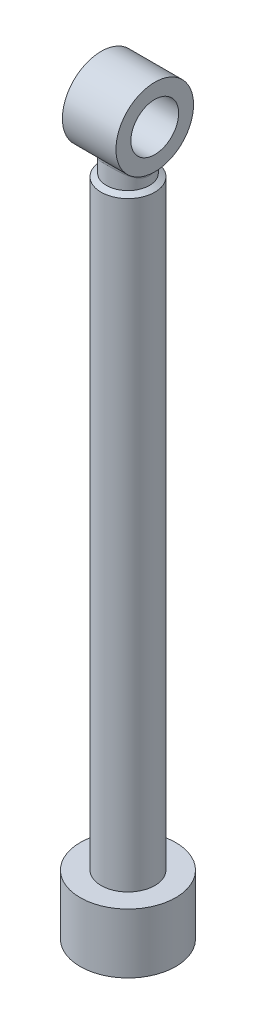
ISO-10303-21;
HEADER;
FILE_DESCRIPTION(('STEP AP214'),'2;1');
FILE_NAME('part.step','',(''),(''),'','','');
FILE_SCHEMA(('AUTOMOTIVE_DESIGN { 1 0 10303 214 1 1 1 1 }'));
ENDSEC;
DATA;
#1=APPLICATION_CONTEXT('core data for automotive mechanical design processes');
#2=APPLICATION_PROTOCOL_DEFINITION('international standard','automotive_design',2000,#1);
#3=PRODUCT_CONTEXT('',#1,'mechanical');
#4=PRODUCT('Part','Part','',(#3));
#5=PRODUCT_RELATED_PRODUCT_CATEGORY('part','',(#4));
#6=PRODUCT_DEFINITION_FORMATION('','',#4);
#7=PRODUCT_DEFINITION_CONTEXT('part definition',#1,'design');
#8=PRODUCT_DEFINITION('design','',#6,#7);
#9=PRODUCT_DEFINITION_SHAPE('','',#8);
#10=(LENGTH_UNIT() NAMED_UNIT(*) SI_UNIT(.MILLI.,.METRE.));
#11=(NAMED_UNIT(*) PLANE_ANGLE_UNIT() SI_UNIT($,.RADIAN.));
#12=(NAMED_UNIT(*) SI_UNIT($,.STERADIAN.) SOLID_ANGLE_UNIT());
#13=UNCERTAINTY_MEASURE_WITH_UNIT(LENGTH_MEASURE(1.E-05),#10,'distance_accuracy_value','');
#14=(GEOMETRIC_REPRESENTATION_CONTEXT(3) GLOBAL_UNCERTAINTY_ASSIGNED_CONTEXT((#13)) GLOBAL_UNIT_ASSIGNED_CONTEXT((#10,
#11,#12)) REPRESENTATION_CONTEXT('',''));
#15=CARTESIAN_POINT('',(0.,0.,0.));
#16=DIRECTION('',(0.,0.,1.));
#17=DIRECTION('',(1.,0.,0.));
#18=AXIS2_PLACEMENT_3D('',#15,#16,#17);
#19=CARTESIAN_POINT('',(22.43,499.528729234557,1624.18659919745));
#20=DIRECTION('',(-1.,0.,0.));
#21=DIRECTION('',(0.,0.,1.));
#22=AXIS2_PLACEMENT_3D('',#19,#20,#21);
#23=CYLINDRICAL_SURFACE('',#22,32.5);
#24=CARTESIAN_POINT('',(22.43,499.528729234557,1624.18659919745));
#25=DIRECTION('',(1.,0.,0.));
#26=DIRECTION('',(0.,0.,-1.));
#27=AXIS2_PLACEMENT_3D('',#24,#25,#26);
#28=CIRCLE('',#27,32.5);
#29=CARTESIAN_POINT('',(22.43,467.329351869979,1619.77637274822));
#30=VERTEX_POINT('',#29);
#31=CARTESIAN_POINT('',(22.43,467.329351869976,1628.59682564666));
#32=VERTEX_POINT('',#31);
#33=EDGE_CURVE('E84',#30,#32,#28,.T.);
#34=ORIENTED_EDGE('',*,*,#33,.F.);
#35=CARTESIAN_POINT('',(22.6907177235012,467.192436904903,1627.4445430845));
#36=CARTESIAN_POINT('',(17.8374693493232,467.112242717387,1626.64858625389));
#37=CARTESIAN_POINT('',(17.757953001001,462.217622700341,1627.12855521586));
#38=CARTESIAN_POINT('',(22.7401800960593,467.166364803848,1627.18580066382));
#39=CARTESIAN_POINT('',(17.8639476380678,467.098629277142,1626.44946773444));
#40=CARTESIAN_POINT('',(17.7966626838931,462.187539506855,1626.8949082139));
#41=CARTESIAN_POINT('',(22.783795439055,467.14332574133,1626.9259483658));
#42=CARTESIAN_POINT('',(17.8870564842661,467.086751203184,1626.25099962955));
#43=CARTESIAN_POINT('',(17.8307964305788,462.160955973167,1626.66025898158));
#44=CARTESIAN_POINT('',(22.8591986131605,467.103440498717,1626.40448441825));
#45=CARTESIAN_POINT('',(17.9267990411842,467.066327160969,1625.85443345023));
#46=CARTESIAN_POINT('',(17.8898076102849,462.114934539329,1626.18937180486));
#47=CARTESIAN_POINT('',(22.8909863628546,467.086594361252,1626.14287275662));
#48=CARTESIAN_POINT('',(17.9434078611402,467.057793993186,1625.6564561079));
#49=CARTESIAN_POINT('',(17.9146849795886,462.095496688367,1625.95313384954));
#50=CARTESIAN_POINT('',(22.9683892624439,467.045545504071,1625.35627636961));
#51=CARTESIAN_POINT('',(17.9837877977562,467.03705122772,1625.06256456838));
#52=CARTESIAN_POINT('',(17.9752611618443,462.048132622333,1625.2428294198));
#53=CARTESIAN_POINT('',(22.9960785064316,467.030814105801,1624.82935037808));
#54=CARTESIAN_POINT('',(17.997978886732,467.029766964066,1624.66811037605));
#55=CARTESIAN_POINT('',(17.9969310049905,462.031134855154,1624.76700996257));
#56=CARTESIAN_POINT('',(23.0031277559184,467.027066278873,1623.77805933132));
#57=CARTESIAN_POINT('',(18.0016119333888,467.027901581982,1623.88047866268));
#58=CARTESIAN_POINT('',(18.0024478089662,462.026810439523,1623.81768359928));
#59=CARTESIAN_POINT('',(22.9827445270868,467.037913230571,1623.25369559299));
#60=CARTESIAN_POINT('',(17.9911760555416,467.033257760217,1623.48831098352));
#61=CARTESIAN_POINT('',(17.9864957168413,462.039326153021,1623.34417788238));
#62=CARTESIAN_POINT('',(22.8945170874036,467.084733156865,1622.20914544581));
#63=CARTESIAN_POINT('',(17.9453145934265,467.056813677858,1622.70163556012));
#64=CARTESIAN_POINT('',(17.917448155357,462.093349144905,1622.40093861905));
#65=CARTESIAN_POINT('',(22.826678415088,467.120703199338,1621.68895855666));
#66=CARTESIAN_POINT('',(17.9100073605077,467.074952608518,1622.30811432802));
#67=CARTESIAN_POINT('',(17.864357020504,462.134853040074,1621.93120463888));
#68=CARTESIAN_POINT('',(22.6522558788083,467.212748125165,1620.70053031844));
#69=CARTESIAN_POINT('',(17.8171515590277,467.122686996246,1621.55102775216));
#70=CARTESIAN_POINT('',(17.7278524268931,462.24105872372,1621.03864402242));
#71=CARTESIAN_POINT('',(22.5494169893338,467.266874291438,1620.23160428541));
#72=CARTESIAN_POINT('',(17.7619326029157,467.151082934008,1621.18861656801));
#73=CARTESIAN_POINT('',(17.6473698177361,462.303511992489,1620.61519910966));
#74=CARTESIAN_POINT('',(22.3060363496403,467.394208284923,1619.30379054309));
#75=CARTESIAN_POINT('',(17.6280623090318,467.219909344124,1620.46120596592));
#76=CARTESIAN_POINT('',(17.4568980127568,462.450435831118,1619.77737399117));
#77=CARTESIAN_POINT('',(22.1654929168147,467.467416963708,1618.84490328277));
#78=CARTESIAN_POINT('',(17.5496692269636,467.260207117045,1620.09685402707));
#79=CARTESIAN_POINT('',(17.3469075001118,462.534907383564,1619.36299419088));
#80=CARTESIAN_POINT('',(21.848184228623,467.631428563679,1617.93968731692));
#81=CARTESIAN_POINT('',(17.3679556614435,467.35345850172,1619.36632078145));
#82=CARTESIAN_POINT('',(17.0985789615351,462.724151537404,1618.54557509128));
#83=CARTESIAN_POINT('',(21.6714047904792,467.722238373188,1617.49336360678));
#84=CARTESIAN_POINT('',(17.2649507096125,467.406251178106,1619.00069475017));
#85=CARTESIAN_POINT('',(16.960229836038,462.828932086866,1618.14254030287));
#86=CARTESIAN_POINT('',(21.2833952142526,467.919645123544,1616.61572419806));
#87=CARTESIAN_POINT('',(17.0327078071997,467.524834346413,1618.26938252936));
#88=CARTESIAN_POINT('',(16.6565701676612,463.056709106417,1617.35002311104));
#89=CARTESIAN_POINT('',(21.0721635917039,468.026242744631,1616.18440914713));
#90=CARTESIAN_POINT('',(16.9038427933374,467.590437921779,1617.90414148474));
#91=CARTESIAN_POINT('',(16.4912584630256,463.179706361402,1616.96054129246));
#92=CARTESIAN_POINT('',(20.6034152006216,468.260051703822,1615.31331423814));
#93=CARTESIAN_POINT('',(16.6104028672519,467.738890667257,1617.15419397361));
#94=CARTESIAN_POINT('',(16.1244118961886,463.449485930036,1616.17393384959));
#95=CARTESIAN_POINT('',(20.3438818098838,468.388116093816,1614.87457911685));
#96=CARTESIAN_POINT('',(16.44452138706,467.822359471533,1616.76976922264));
#97=CARTESIAN_POINT('',(15.9212988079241,463.597252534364,1615.77775163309));
#98=CARTESIAN_POINT('',(19.7902128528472,468.657264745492,1614.01780235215));
#99=CARTESIAN_POINT('',(16.0813394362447,468.003299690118,1616.00632988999));
#100=CARTESIAN_POINT('',(15.4879926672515,463.907808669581,1615.00407361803));
#101=CARTESIAN_POINT('',(19.4960633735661,468.798354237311,1613.59976912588));
#102=CARTESIAN_POINT('',(15.8845078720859,468.100555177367,1615.62753534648));
#103=CARTESIAN_POINT('',(15.257788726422,464.070604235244,1614.62658542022));
#104=CARTESIAN_POINT('',(18.8751332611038,469.090923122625,1612.78585050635));
#105=CARTESIAN_POINT('',(15.4591572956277,468.307889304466,1614.87867773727));
#106=CARTESIAN_POINT('',(14.7718434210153,464.408183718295,1613.89160874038));
#107=CARTESIAN_POINT('',(18.5483365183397,469.242407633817,1612.3899761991));
#108=CARTESIAN_POINT('',(15.2310794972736,468.417781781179,1614.5086804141));
#109=CARTESIAN_POINT('',(14.5160894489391,464.582973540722,1613.53413026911));
#110=CARTESIAN_POINT('',(17.8640849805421,469.55295328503,1611.62178548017));
#111=CARTESIAN_POINT('',(14.7435363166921,468.648584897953,1613.78095967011));
#112=CARTESIAN_POINT('',(13.9805882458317,464.941295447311,1612.84044634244));
#113=CARTESIAN_POINT('',(17.5066272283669,469.712015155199,1611.24947134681));
#114=CARTESIAN_POINT('',(14.4844756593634,468.769348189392,1613.42315919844));
#115=CARTESIAN_POINT('',(13.7008387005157,465.124828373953,1612.50424294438));
#116=CARTESIAN_POINT('',(16.7101203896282,470.057691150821,1610.47854847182));
#117=CARTESIAN_POINT('',(13.8972001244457,469.037115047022,1612.6742041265));
#118=CARTESIAN_POINT('',(13.0774855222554,465.523685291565,1611.80809185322));
#119=CARTESIAN_POINT('',(16.2666802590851,470.245021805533,1610.08366154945));
#120=CARTESIAN_POINT('',(13.5643086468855,469.185534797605,1612.28450826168));
#121=CARTESIAN_POINT('',(12.7304454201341,465.73983604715,1611.45150500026));
#122=CARTESIAN_POINT('',(15.3441405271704,470.621439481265,1609.32735724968));
#123=CARTESIAN_POINT('',(12.859555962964,469.48974608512,1611.52995952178));
#124=CARTESIAN_POINT('',(12.0084578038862,466.174164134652,1610.76855462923));
#125=CARTESIAN_POINT('',(14.8650363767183,470.810526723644,1608.96594415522));
#126=CARTESIAN_POINT('',(12.4880483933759,469.645502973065,1611.1646540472));
#127=CARTESIAN_POINT('',(11.6335067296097,466.392341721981,1610.44219497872));
#128=CARTESIAN_POINT('',(13.8729413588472,471.185823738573,1608.27800829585));
#129=CARTESIAN_POINT('',(11.7075986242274,469.959663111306,1610.46318701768));
#130=CARTESIAN_POINT('',(10.8570845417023,466.825376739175,1609.82098199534));
#131=CARTESIAN_POINT('',(13.3599428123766,471.372032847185,1607.95149348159));
#132=CARTESIAN_POINT('',(11.298842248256,470.118136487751,1610.12645993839));
#133=CARTESIAN_POINT('',(10.4556074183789,467.040233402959,1609.52613584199));
#134=CARTESIAN_POINT('',(12.3019050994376,471.736534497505,1607.33512784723));
#135=CARTESIAN_POINT('',(10.4458694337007,470.432344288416,1609.48644764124));
#136=CARTESIAN_POINT('',(9.6275779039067,467.460812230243,1608.96955148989));
#137=CARTESIAN_POINT('',(11.7568699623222,471.914828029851,1607.04527243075));
#138=CARTESIAN_POINT('',(10.0016745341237,470.588245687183,1609.18251389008));
#139=CARTESIAN_POINT('',(9.20102866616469,467.666535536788,1608.70780914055));
#140=CARTESIAN_POINT('',(10.6973962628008,472.239513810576,1606.53354444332));
#141=CARTESIAN_POINT('',(9.129684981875,470.875120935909,1608.64288387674));
#142=CARTESIAN_POINT('',(8.37187533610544,468.041172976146,1608.24571363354));
#143=CARTESIAN_POINT('',(10.1860616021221,472.387267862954,1606.30770756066));
#144=CARTESIAN_POINT('',(8.70563242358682,471.007014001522,1608.4031083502));
#145=CARTESIAN_POINT('',(7.9717003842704,468.211658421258,1608.0417806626));
#146=CARTESIAN_POINT('',(9.14094817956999,472.668210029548,1605.88834205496));
#147=CARTESIAN_POINT('',(7.8331774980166,471.259518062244,1607.95629961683));
#148=CARTESIAN_POINT('',(7.15378553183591,468.535822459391,1607.66308940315));
#149=CARTESIAN_POINT('',(8.60717335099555,472.801400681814,1605.69480779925));
#150=CARTESIAN_POINT('',(7.38452764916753,471.380345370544,1607.7487827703));
#151=CARTESIAN_POINT('',(6.73604870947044,468.68950398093,1607.48832602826));
#152=CARTESIAN_POINT('',(7.51979357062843,473.048942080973,1605.34204318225));
#153=CARTESIAN_POINT('',(6.46590388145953,471.606029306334,1607.36962924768));
#154=CARTESIAN_POINT('',(5.88505583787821,468.975128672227,1607.16977603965));
#155=CARTESIAN_POINT('',(6.96621265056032,473.163314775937,1605.18277279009));
#156=CARTESIAN_POINT('',(5.99557568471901,471.711136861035,1607.19750108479));
#157=CARTESIAN_POINT('',(5.45181859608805,469.107097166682,1607.02595327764));
#158=CARTESIAN_POINT('',(5.8414305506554,473.369312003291,1604.90019113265));
#159=CARTESIAN_POINT('',(5.03643276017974,471.901059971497,1606.89169879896));
#160=CARTESIAN_POINT('',(4.57155434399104,469.344786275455,1606.77077920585));
#161=CARTESIAN_POINT('',(5.27023126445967,473.460938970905,1604.77687601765));
#162=CARTESIAN_POINT('',(4.54710678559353,471.986106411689,1606.75762162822));
#163=CARTESIAN_POINT('',(4.12452881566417,469.450509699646,1606.65942441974));
#164=CARTESIAN_POINT('',(4.16672989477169,473.610579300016,1604.57758120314));
#165=CARTESIAN_POINT('',(3.59937640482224,472.125252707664,1606.54081159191));
#166=CARTESIAN_POINT('',(3.26091904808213,469.623171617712,1606.47945920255));
#167=CARTESIAN_POINT('',(3.63563669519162,473.670897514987,1604.4983081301));
#168=CARTESIAN_POINT('',(3.14188286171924,472.181602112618,1606.45429155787));
#169=CARTESIAN_POINT('',(2.84528089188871,469.69276955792,1606.40787482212));
#170=CARTESIAN_POINT('',(2.56547339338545,473.767456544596,1604.37213010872));
#171=CARTESIAN_POINT('',(2.21894335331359,472.271842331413,1606.31661584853));
#172=CARTESIAN_POINT('',(2.00776178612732,469.804183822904,1606.29393480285));
#173=CARTESIAN_POINT('',(2.02640407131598,473.803699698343,1604.32522201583));
#174=CARTESIAN_POINT('',(1.75295656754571,472.305843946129,1606.26528838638));
#175=CARTESIAN_POINT('',(1.5858814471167,469.846002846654,1606.25157632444));
#176=CARTESIAN_POINT('',(0.944482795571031,473.850662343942,1604.26454166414));
#177=CARTESIAN_POINT('',(0.817518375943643,472.34986660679,1606.19895697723));
#178=CARTESIAN_POINT('',(0.739160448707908,469.90019051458,1606.19678135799));
#179=CARTESIAN_POINT('',(0.401632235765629,473.861390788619,1604.25075778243));
#180=CARTESIAN_POINT('',(0.347483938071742,472.359951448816,1606.18385661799));
#181=CARTESIAN_POINT('',(0.314320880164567,469.912569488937,1606.18433437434));
#182=CARTESIAN_POINT('',(-0.683717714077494,473.856914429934,1604.25652354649));
#183=CARTESIAN_POINT('',(-0.591610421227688,472.355752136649,1606.19016198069));
#184=CARTESIAN_POINT('',(-0.535083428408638,469.907404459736,1606.18954091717));
#185=CARTESIAN_POINT('',(-1.22621707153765,473.841707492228,1604.27607593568));
#186=CARTESIAN_POINT('',(-1.0612679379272,472.34146062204,1606.21157873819));
#187=CARTESIAN_POINT('',(-0.95964814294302,469.889857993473,1606.20719692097));
#188=CARTESIAN_POINT('',(-2.3649448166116,473.782949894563,1604.35209750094));
#189=CARTESIAN_POINT('',(-2.04558863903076,472.286395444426,1606.29467072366));
#190=CARTESIAN_POINT('',(-1.85082637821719,469.822060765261,1606.27584515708));
#191=CARTESIAN_POINT('',(-2.9606446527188,473.736514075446,1604.41232747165));
#192=CARTESIAN_POINT('',(-2.56029988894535,472.242845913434,1606.36056910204));
#193=CARTESIAN_POINT('',(-2.31702624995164,469.768480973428,1606.33023342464));
#194=CARTESIAN_POINT('',(-4.14096443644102,473.614759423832,1604.57216142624));
#195=CARTESIAN_POINT('',(-3.57718648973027,472.129201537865,1606.53483529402));
#196=CARTESIAN_POINT('',(-3.24075477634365,469.627994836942,1606.47456508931));
#197=CARTESIAN_POINT('',(-4.72558285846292,473.539436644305,1604.67177079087));
#198=CARTESIAN_POINT('',(-4.08007430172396,472.058937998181,1606.64346741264));
#199=CARTESIAN_POINT('',(-3.69828223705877,469.541083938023,1606.56451334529));
#200=CARTESIAN_POINT('',(-5.87987501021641,473.363149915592,1604.90878221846));
#201=CARTESIAN_POINT('',(-5.06907996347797,471.895475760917,1606.90084853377));
#202=CARTESIAN_POINT('',(-4.60164131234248,469.337676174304,1606.77853704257));
#203=CARTESIAN_POINT('',(-6.44953175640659,473.262158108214,1605.04622535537));
#204=CARTESIAN_POINT('',(-5.55578346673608,471.802036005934,1607.04999956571));
#205=CARTESIAN_POINT('',(-5.04745963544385,469.221147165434,1606.90264957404));
#206=CARTESIAN_POINT('',(-7.57005936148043,473.038509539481,1605.35697143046));
#207=CARTESIAN_POINT('',(-6.50835083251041,471.596600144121,1607.38552341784));
#208=CARTESIAN_POINT('',(-5.92439428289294,468.963091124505,1607.18325639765));
#209=CARTESIAN_POINT('',(-8.12092089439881,472.915842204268,1605.53029187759));
#210=CARTESIAN_POINT('',(-6.97468152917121,471.48435623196,1607.57234509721));
#211=CARTESIAN_POINT('',(-6.35550330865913,468.821551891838,1607.33976650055));
#212=CARTESIAN_POINT('',(-9.19627826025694,472.654270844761,1605.90912948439));
#213=CARTESIAN_POINT('',(-7.87940266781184,471.247059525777,1607.97828643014));
#214=CARTESIAN_POINT('',(-7.19708733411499,468.519738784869,1607.68186066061));
#215=CARTESIAN_POINT('',(-9.72096464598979,472.515520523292,1606.11434736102));
#216=CARTESIAN_POINT('',(-8.31836808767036,471.121892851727,1608.1975818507));
#217=CARTESIAN_POINT('',(-7.60771146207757,468.359642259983,1607.8671744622));
#218=CARTESIAN_POINT('',(-10.7471516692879,472.225069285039,1606.5562211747));
#219=CARTESIAN_POINT('',(-9.17072792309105,470.862402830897,1608.66662974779));
#220=CARTESIAN_POINT('',(-8.4108143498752,468.02450621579,1608.26619094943));
#221=CARTESIAN_POINT('',(-11.2486539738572,472.073369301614,1606.79287484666));
#222=CARTESIAN_POINT('',(-9.5843264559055,470.727879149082,1608.91685777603));
#223=CARTESIAN_POINT('',(-8.80329441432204,467.849467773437,1608.4798915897));
#224=CARTESIAN_POINT('',(-12.7166745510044,471.604636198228,1607.5479477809));
#225=CARTESIAN_POINT('',(-10.7899514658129,470.31516345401,1609.71271499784));
#226=CARTESIAN_POINT('',(-9.95218008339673,467.308621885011,1609.16173002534));
#227=CARTESIAN_POINT('',(-13.6472348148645,471.273834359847,1608.11166700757));
#228=CARTESIAN_POINT('',(-11.5367001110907,470.030505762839,1610.29936661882));
#229=CARTESIAN_POINT('',(-10.6804446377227,466.926927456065,1609.67077414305));
#230=CARTESIAN_POINT('',(-15.0239228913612,470.748522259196,1609.08322755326));
#231=CARTESIAN_POINT('',(-12.611893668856,469.594146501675,1611.28349316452));
#232=CARTESIAN_POINT('',(-11.7578526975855,466.32079810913,1610.5481030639));
#233=CARTESIAN_POINT('',(-15.5067819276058,470.55634365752,1609.45437162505));
#234=CARTESIAN_POINT('',(-12.9850008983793,469.436507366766,1611.65771048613));
#235=CARTESIAN_POINT('',(-12.1357423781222,466.099053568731,1610.88324988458));
#236=CARTESIAN_POINT('',(-16.4356458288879,470.174263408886,1610.23122656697));
#237=CARTESIAN_POINT('',(-13.6918027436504,469.129173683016,1612.43052233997));
#238=CARTESIAN_POINT('',(-12.8626793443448,465.658191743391,1611.58475769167));
#239=CARTESIAN_POINT('',(-16.8816477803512,469.984361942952,1610.63694016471));
#240=CARTESIAN_POINT('',(-14.0251002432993,468.979529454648,1612.82958068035));
#241=CARTESIAN_POINT('',(-13.2117243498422,465.439074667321,1611.95112114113));
#242=CARTESIAN_POINT('',(-17.7344574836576,469.611458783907,1611.48147510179));
#243=CARTESIAN_POINT('',(-14.6511631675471,468.692227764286,1613.64757013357));
#244=CARTESIAN_POINT('',(-13.8791406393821,465.008801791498,1612.71374466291));
#245=CARTESIAN_POINT('',(-18.1412484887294,469.428460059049,1611.92031044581));
#246=CARTESIAN_POINT('',(-14.9433603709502,468.554737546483,1614.06678864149));
#247=CARTESIAN_POINT('',(-14.1974988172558,464.797649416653,1613.11001738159));
#248=CARTESIAN_POINT('',(-18.9127535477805,469.073868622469,1612.8292502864));
#249=CARTESIAN_POINT('',(-15.4865138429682,468.294991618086,1614.92020561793));
#250=CARTESIAN_POINT('',(-14.801285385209,464.388505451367,1613.93079917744));
#251=CARTESIAN_POINT('',(-19.2774715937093,468.902274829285,1613.2993518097));
#252=CARTESIAN_POINT('',(-15.7368075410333,468.17299116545,1615.35445804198));
#253=CARTESIAN_POINT('',(-15.0867168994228,464.190512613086,1614.35530556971));
#254=CARTESIAN_POINT('',(-19.9755613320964,468.568161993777,1614.28829436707));
#255=CARTESIAN_POINT('',(-16.2055502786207,467.941908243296,1616.25105281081));
#256=CARTESIAN_POINT('',(-15.6330479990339,463.80499780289,1615.24833062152));
#257=CARTESIAN_POINT('',(-20.3070880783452,468.406283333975,1614.80833419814));
#258=CARTESIAN_POINT('',(-16.4213706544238,467.833966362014,1616.71333743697));
#259=CARTESIAN_POINT('',(-15.8925037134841,463.618214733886,1615.71793180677));
#260=CARTESIAN_POINT('',(-20.9176287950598,468.104031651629,1615.87716106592));
#261=CARTESIAN_POINT('',(-16.8094008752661,467.638473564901,1617.64384211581));
#262=CARTESIAN_POINT('',(-16.3703181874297,463.269462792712,1616.68309319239));
#263=CARTESIAN_POINT('',(-21.1966394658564,467.963659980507,1616.42594990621));
#264=CARTESIAN_POINT('',(-16.9807560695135,467.551332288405,1618.11147706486));
#265=CARTESIAN_POINT('',(-16.5886743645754,463.107495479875,1617.17865502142));
#266=CARTESIAN_POINT('',(-21.6978377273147,467.708899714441,1617.5474356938));
#267=CARTESIAN_POINT('',(-17.2814499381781,467.397852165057,1619.04755479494));
#268=CARTESIAN_POINT('',(-16.9809164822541,462.813541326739,1618.19136793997));
#269=CARTESIAN_POINT('',(-21.920121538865,467.59446715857,1618.12009021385));
#270=CARTESIAN_POINT('',(-17.4100752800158,467.331871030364,1619.51508290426));
#271=CARTESIAN_POINT('',(-17.1548777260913,462.681503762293,1618.70848071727));
#272=CARTESIAN_POINT('',(-22.3048208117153,467.39501026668,1619.28525492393));
#273=CARTESIAN_POINT('',(-17.6282810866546,467.219817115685,1620.44889501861));
#274=CARTESIAN_POINT('',(-17.4559467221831,462.451361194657,1619.76063614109));
#275=CARTESIAN_POINT('',(-22.4672496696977,467.309979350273,1619.87776063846));
#276=CARTESIAN_POINT('',(-17.7172183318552,467.1740733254,1620.91396550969));
#277=CARTESIAN_POINT('',(-17.5830649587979,462.353248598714,1620.29567474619));
#278=CARTESIAN_POINT('',(-22.7112716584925,467.181693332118,1620.99436270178));
#279=CARTESIAN_POINT('',(-17.8490016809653,467.106310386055,1621.77792595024));
#280=CARTESIAN_POINT('',(-17.7740386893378,462.205226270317,1621.30397761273));
#281=CARTESIAN_POINT('',(-22.8009047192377,467.134303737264,1621.51667388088));
#282=CARTESIAN_POINT('',(-17.8962310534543,467.082034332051,1622.17647978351));
#283=CARTESIAN_POINT('',(-17.844186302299,462.150545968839,1621.77562984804));
#284=CARTESIAN_POINT('',(-22.9321017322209,467.064819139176,1622.56743321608));
#285=CARTESIAN_POINT('',(-17.9650183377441,467.046689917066,1622.97262584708));
#286=CARTESIAN_POINT('',(-17.9468622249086,462.070371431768,1622.72447607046));
#287=CARTESIAN_POINT('',(-22.9736716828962,467.04272097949,1623.09588059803));
#288=CARTESIAN_POINT('',(-17.9864047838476,467.035709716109,1623.36922207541));
#289=CARTESIAN_POINT('',(-17.9793952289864,462.044873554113,1623.20166935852));
#290=CARTESIAN_POINT('',(-23.0081865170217,467.024379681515,1624.15776394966));
#291=CARTESIAN_POINT('',(-18.0042381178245,467.026552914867,1624.16539407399));
#292=CARTESIAN_POINT('',(-18.0064068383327,462.023710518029,1624.16056067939));
#293=CARTESIAN_POINT('',(-23.0008299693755,467.028296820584,1624.69121058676));
#294=CARTESIAN_POINT('',(-18.0004836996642,467.028479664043,1624.56392309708));
#295=CARTESIAN_POINT('',(-18.0006495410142,462.028230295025,1624.64226834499));
#296=CARTESIAN_POINT('',(-22.9529136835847,467.0537433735,1625.48902293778));
#297=CARTESIAN_POINT('',(-17.9756431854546,467.04123617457,1625.16347147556));
#298=CARTESIAN_POINT('',(-17.9631498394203,462.057591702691,1625.36270090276));
#299=CARTESIAN_POINT('',(-22.9307811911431,467.065494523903,1625.75465530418));
#300=CARTESIAN_POINT('',(-17.9641744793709,467.047126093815,1625.36335701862));
#301=CARTESIAN_POINT('',(-17.9458287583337,462.071150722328,1625.60256959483));
#302=CARTESIAN_POINT('',(-22.8743141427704,467.095429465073,1626.28457806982));
#303=CARTESIAN_POINT('',(-17.934691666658,467.062271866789,1625.76365862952));
#304=CARTESIAN_POINT('',(-17.9016371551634,462.105691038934,1626.08109516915));
#305=CARTESIAN_POINT('',(-22.8399797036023,467.113613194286,1626.54886848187));
#306=CARTESIAN_POINT('',(-17.9166967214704,467.071517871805,1625.96394692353));
#307=CARTESIAN_POINT('',(-17.8747667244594,462.12667226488,1626.31975206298));
#308=CARTESIAN_POINT('',(-22.7995963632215,467.13496444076,1626.81224244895));
#309=CARTESIAN_POINT('',(-17.8953515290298,467.082488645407,1626.16482449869));
#310=CARTESIAN_POINT('',(-17.8431623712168,462.151308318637,1626.55758139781));
#311=(BOUNDED_SURFACE() B_SPLINE_SURFACE(3,2,((#35,#36,#37),(#38,#39,#40),(#41,#42,#43),(#44,
#45,#46),(#47,#48,#49),(#50,#51,#52),(#53,#54,#55),(#56,#57,#58),(#59,#60,#61),(#62,#63,#64),
(#65,#66,#67),(#68,#69,#70),(#71,#72,#73),(#74,#75,#76),(#77,#78,#79),(#80,#81,#82),(#83,#84,
#85),(#86,#87,#88),(#89,#90,#91),(#92,#93,#94),(#95,#96,#97),(#98,#99,#100),(#101,#102,#103),
(#104,#105,#106),(#107,#108,#109),(#110,#111,#112),(#113,#114,#115),(#116,#117,#118),(#119,#120,
#121),(#122,#123,#124),(#125,#126,#127),(#128,#129,#130),(#131,#132,#133),(#134,#135,#136),
(#137,#138,#139),(#140,#141,#142),(#143,#144,#145),(#146,#147,#148),(#149,#150,#151),(#152,#153,
#154),(#155,#156,#157),(#158,#159,#160),(#161,#162,#163),(#164,#165,#166),(#167,#168,#169),
(#170,#171,#172),(#173,#174,#175),(#176,#177,#178),(#179,#180,#181),(#182,#183,#184),(#185,#186,
#187),(#188,#189,#190),(#191,#192,#193),(#194,#195,#196),(#197,#198,#199),(#200,#201,#202),
(#203,#204,#205),(#206,#207,#208),(#209,#210,#211),(#212,#213,#214),(#215,#216,#217),(#218,#219,
#220),(#221,#222,#223),(#224,#225,#226),(#227,#228,#229),(#230,#231,#232),(#233,#234,#235),
(#236,#237,#238),(#239,#240,#241),(#242,#243,#244),(#245,#246,#247),(#248,#249,#250),(#251,#252,
#253),(#254,#255,#256),(#257,#258,#259),(#260,#261,#262),(#263,#264,#265),(#266,#267,#268),
(#269,#270,#271),(#272,#273,#274),(#275,#276,#277),(#278,#279,#280),(#281,#282,#283),(#284,#285,
#286),(#287,#288,#289),(#290,#291,#292),(#293,#294,#295),(#296,#297,#298),(#299,#300,#301),
(#302,#303,#304),(#305,#306,#307),(#308,#309,#310)),.UNSPECIFIED.,.F.,.F.,
.F.) B_SPLINE_SURFACE_WITH_KNOTS((4,2,2,2,2,2,2,2,2,2,2,2,2,2,2,2,2,2,2,2,2,2,2,2,2,2,2,2,2,2,2,
2,2,2,2,2,2,2,2,2,2,2,2,2,2,4),(3,3),(0.,0.912168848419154,1.82434397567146,3.64806239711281,
5.46206201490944,7.2758499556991,8.93685630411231,10.5979367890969,12.2596686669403,
13.921472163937,15.6829796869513,17.4451976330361,19.2082894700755,20.9715515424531,
22.984046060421,24.9967977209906,27.0100069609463,29.0229635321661,30.8173458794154,
32.6114150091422,34.4033765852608,36.1951462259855,37.8233585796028,39.4514127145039,
41.0788954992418,42.7065122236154,44.510003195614,46.3137406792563,48.1194441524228,
49.9260309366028,51.7165901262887,53.5070203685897,57.086120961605,59.1317391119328,
61.1775188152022,63.2241684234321,65.270623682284,67.3991920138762,69.5278940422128,
71.6529609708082,73.7775519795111,75.6102502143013,77.4427196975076,79.2864892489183,
80.2089871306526,81.1314761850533),(0.,1.),
.UNSPECIFIED.) GEOMETRIC_REPRESENTATION_ITEM() RATIONAL_B_SPLINE_SURFACE(((1.,0.712875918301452,
1.),(1.,0.711963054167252,1.),(1.,0.711153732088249,1.),(1.,0.709749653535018,1.),(1.,
0.709154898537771,1.),(1.,0.707704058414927,1.),(1.,0.707180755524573,1.),(1.,0.707047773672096,
1.),(1.,0.707433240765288,1.),(1.,0.709089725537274,1.),(1.,0.710360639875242,1.),(1.,
0.713589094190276,1.),(1.,0.715479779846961,1.),(1.,0.719888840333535,1.),(1.,0.722407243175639,
1.),(1.,0.727989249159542,1.),(1.,0.731053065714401,1.),(1.,0.737631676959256,1.),(1.,
0.741146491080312,1.),(1.,0.748751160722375,1.),(1.,0.75286286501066,1.),(1.,0.761369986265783,
1.),(1.,0.7657655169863,1.),(1.,0.774731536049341,1.),(1.,0.779302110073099,1.),(1.,
0.788514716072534,1.),(1.,0.793156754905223,1.),(1.,0.803073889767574,1.),(1.,0.808345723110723,
1.),(1.,0.818735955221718,1.),(1.,0.82385433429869,1.),(1.,0.833824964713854,1.),(1.,
0.838677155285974,1.),(1.,0.848008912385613,1.),(1.,0.852488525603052,1.),(1.,0.860515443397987,
1.),(1.,0.864111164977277,1.),(1.,0.870860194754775,1.),(1.,0.874013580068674,1.),(1.,
0.87980972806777,1.),(1.,0.882453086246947,1.),(1.,0.887172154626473,1.),(1.,0.889247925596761,
1.),(1.,0.892616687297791,1.),(1.,0.893963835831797,1.),(1.,0.896112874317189,1.),(1.,
0.896914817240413,1.),(1.,0.897952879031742,1.),(1.,0.898189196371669,1.),(1.,0.898090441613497,
1.),(1.,0.897755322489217,1.),(1.,0.896455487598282,1.),(1.,0.895426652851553,1.),(1.,
0.892709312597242,1.),(1.,0.891020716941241,1.),(1.,0.88702971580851,1.),(1.,0.884726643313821,
1.),(1.,0.879565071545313,1.),(1.,0.876706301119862,1.),(1.,0.870525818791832,1.),(1.,
0.867208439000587,1.),(1.,0.860159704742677,1.),(1.,0.856428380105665,1.),(1.,0.84470950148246,
1.),(1.,0.836193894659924,1.),(1.,0.82218466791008,1.),(1.,0.81695950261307,1.),(1.,
0.806363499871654,1.),(1.,0.800992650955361,1.),(1.,0.790237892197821,1.),(1.,0.784853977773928,
1.),(1.,0.77422433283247,1.),(1.,0.768978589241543,1.),(1.,0.758584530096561,1.),(1.,
0.753448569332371,1.),(1.,0.743702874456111,1.),(1.,0.739093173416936,1.),(1.,0.730613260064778,
1.),(1.,0.726741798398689,1.),(1.,0.719924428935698,1.),(1.,0.716978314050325,1.),(1.,
0.712504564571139,1.),(1.,0.710837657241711,1.),(1.,0.708386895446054,1.),(1.,0.707602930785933,
1.),(1.,0.706952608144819,1.),(1.,0.707091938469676,1.),(1.,0.707993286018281,1.),(1.,
0.70840938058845,1.),(1.,0.709466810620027,1.),(1.,0.710108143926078,1.),(1.,0.710859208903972,1.))) REPRESENTATION_ITEM('') SURFACE());
#312=CARTESIAN_POINT('',(0.,473.859443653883,1644.11993253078));
#313=CARTESIAN_POINT('',(1.16862814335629,473.859410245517,1644.11992136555));
#314=CARTESIAN_POINT('',(2.33719745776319,473.799091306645,1644.04267877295));
#315=CARTESIAN_POINT('',(5.4957078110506,473.477885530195,1643.621939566));
#316=CARTESIAN_POINT('',(7.455084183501,473.101797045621,1643.12396957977));
#317=CARTESIAN_POINT('',(11.3034132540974,472.104710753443,1641.65081695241));
#318=CARTESIAN_POINT('',(13.1732972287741,471.46610359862,1640.63973116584));
#319=CARTESIAN_POINT('',(16.8219293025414,470.046585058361,1637.96012869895));
#320=CARTESIAN_POINT('',(18.5446960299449,469.258714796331,1636.21561751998));
#321=CARTESIAN_POINT('',(20.9357800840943,468.103044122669,1632.62630164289));
#322=CARTESIAN_POINT('',(21.7585543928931,467.679697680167,1630.90867703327));
#323=CARTESIAN_POINT('',(22.4515003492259,467.318208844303,1628.55181244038));
#324=CARTESIAN_POINT('',(22.5848355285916,467.248132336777,1628.00263668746));
#325=CARTESIAN_POINT('',(23.0682476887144,466.993851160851,1625.45462345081));
#326=CARTESIAN_POINT('',(23.0967606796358,466.978095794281,1623.35132885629));
#327=CARTESIAN_POINT('',(22.7567698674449,467.157589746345,1621.29458494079));
#328=CARTESIAN_POINT('',(22.7463661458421,467.163082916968,1621.23376864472));
#329=CARTESIAN_POINT('',(22.3998827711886,467.345992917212,1619.27260232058));
#330=CARTESIAN_POINT('',(21.7414077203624,467.692623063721,1617.43307130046));
#331=CARTESIAN_POINT('',(19.8629137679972,468.629195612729,1613.93176034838));
#332=CARTESIAN_POINT('',(18.5956300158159,469.239067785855,1612.30330078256));
#333=CARTESIAN_POINT('',(15.4002656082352,470.62654803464,1609.21099722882));
#334=CARTESIAN_POINT('',(13.3929025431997,471.414186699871,1607.83500235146));
#335=CARTESIAN_POINT('',(9.16536391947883,472.708338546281,1605.79401103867));
#336=CARTESIAN_POINT('',(6.97246637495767,473.231513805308,1605.08340450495));
#337=CARTESIAN_POINT('',(2.57951638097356,473.824510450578,1604.29175972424));
#338=CARTESIAN_POINT('',(0.391863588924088,473.924858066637,1604.16824377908));
#339=CARTESIAN_POINT('',(-4.1371752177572,473.691878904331,1604.47020189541));
#340=CARTESIAN_POINT('',(-6.47248767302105,473.314876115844,1604.95093150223));
#341=CARTESIAN_POINT('',(-10.7667430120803,472.274128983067,1606.4610740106));
#342=CARTESIAN_POINT('',(-12.7365790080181,471.621767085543,1607.46905063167));
#343=CARTESIAN_POINT('',(-16.4834350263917,470.191115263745,1610.11317921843));
#344=CARTESIAN_POINT('',(-18.2231470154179,469.406748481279,1611.80083329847));
#345=CARTESIAN_POINT('',(-20.6923274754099,468.225215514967,1615.30747309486));
#346=CARTESIAN_POINT('',(-21.5625108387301,467.780439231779,1617.0052586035));
#347=CARTESIAN_POINT('',(-22.3246734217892,467.384535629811,1619.35646263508));
#348=CARTESIAN_POINT('',(-22.4755027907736,467.305527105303,1619.91179617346));
#349=CARTESIAN_POINT('',(-23.0238019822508,467.017784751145,1622.43737468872));
#350=CARTESIAN_POINT('',(-23.112010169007,466.969747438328,1624.51902887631));
#351=CARTESIAN_POINT('',(-22.829629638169,467.119075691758,1626.6107281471));
#352=CARTESIAN_POINT('',(-22.8150659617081,467.126780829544,1626.71155710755));
#353=CARTESIAN_POINT('',(-22.5064177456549,467.290059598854,1628.72042314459));
#354=CARTESIAN_POINT('',(-21.887854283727,467.617010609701,1630.57701942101));
#355=CARTESIAN_POINT('',(-20.0882349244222,468.519053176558,1634.10377153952));
#356=CARTESIAN_POINT('',(-18.8639643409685,469.112820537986,1635.74480641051));
#357=CARTESIAN_POINT('',(-15.767396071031,470.476811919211,1638.87050758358));
#358=CARTESIAN_POINT('',(-13.8171216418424,471.259360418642,1640.27011106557));
#359=CARTESIAN_POINT('',(-9.25162911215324,472.70403767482,1642.5949503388));
#360=CARTESIAN_POINT('',(-6.58371691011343,473.338798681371,1643.43879201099));
#361=CARTESIAN_POINT('',(-2.56123476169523,473.787127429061,1644.02721932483));
#362=CARTESIAN_POINT('',(-1.28058206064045,473.859480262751,1644.11994476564));
#363=CARTESIAN_POINT('',(0.,473.859443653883,1644.11993253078));
#364=B_SPLINE_CURVE_WITH_KNOTS('',3,(#312,#313,#314,#315,#316,#317,#318,#319,#320,#321,#322,
#323,#324,#325,#326,#327,#328,#329,#330,#331,#332,#333,#334,#335,#336,#337,#338,#339,#340,#341,
#342,#343,#344,#345,#346,#347,#348,#349,#350,#351,#352,#353,#354,#355,#356,#357,#358,#359,#360,
#361,#362,#363),.UNSPECIFIED.,.T.,.F.,(4,2,2,2,2,2,2,2,2,2,2,2,2,2,2,2,2,2,2,2,2,2,2,2,2,4),(0.,
3.5027853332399,9.59172200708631,16.1818003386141,23.762799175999,29.5032380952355,
31.211143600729,37.3007935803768,37.4866611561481,43.3006747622,49.6651678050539,
57.2208111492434,64.2094040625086,70.6837590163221,77.7956306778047,84.6385621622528,
92.1460990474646,97.9127498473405,99.6547775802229,105.693556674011,106.000142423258,
111.810531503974,118.113177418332,125.581566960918,133.985582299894,137.823932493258),.UNSPECIFIED.);
#365=CARTESIAN_POINT('',(-22.43,467.329351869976,1619.77637274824));
#366=VERTEX_POINT('',#365);
#367=EDGE_CURVE('E92',#30,#366,#364,.T.);
#368=ORIENTED_EDGE('',*,*,#367,.T.);
#369=CARTESIAN_POINT('',(-22.43,499.528729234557,1624.18659919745));
#370=DIRECTION('',(1.,0.,0.));
#371=DIRECTION('',(0.,0.,-1.));
#372=AXIS2_PLACEMENT_3D('',#369,#370,#371);
#373=CIRCLE('',#372,32.5);
#374=CARTESIAN_POINT('',(-22.43,467.32935186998,1628.59682564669));
#375=VERTEX_POINT('',#374);
#376=EDGE_CURVE('E87',#366,#375,#373,.T.);
#377=ORIENTED_EDGE('',*,*,#376,.T.);
#378=CARTESIAN_POINT('',(-3.82240402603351,473.646562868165,1643.84272964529));
#379=CARTESIAN_POINT('',(-3.30188230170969,472.158983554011,1641.88396286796));
#380=CARTESIAN_POINT('',(-2.99144662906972,469.664691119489,1641.93628221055));
#381=CARTESIAN_POINT('',(-3.22193292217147,473.713175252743,1643.93043962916));
#382=CARTESIAN_POINT('',(-2.78578287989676,472.221005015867,1641.97938818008));
#383=CARTESIAN_POINT('',(-2.52151272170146,469.741551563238,1642.01548520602));
#384=CARTESIAN_POINT('',(-2.61532771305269,473.764969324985,1643.99775769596));
#385=CARTESIAN_POINT('',(-2.26188595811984,472.269555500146,1642.05302073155));
#386=CARTESIAN_POINT('',(-2.04677821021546,469.801313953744,1642.0762740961));
#387=CARTESIAN_POINT('',(-1.39534240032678,473.836382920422,1644.09028845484));
#388=CARTESIAN_POINT('',(-1.20772264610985,472.33644771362,1642.15412162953));
#389=CARTESIAN_POINT('',(-1.092007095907,469.883714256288,1642.15983029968));
#390=CARTESIAN_POINT('',(-0.781963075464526,473.856006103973,1644.11550593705));
#391=CARTESIAN_POINT('',(-0.676627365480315,472.354899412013,1642.18175713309));
#392=CARTESIAN_POINT('',(-0.611971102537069,469.906356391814,1642.18260193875));
#393=CARTESIAN_POINT('',(0.445099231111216,473.862051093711,1644.12329012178));
#394=CARTESIAN_POINT('',(0.385076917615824,472.360571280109,1642.19027143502));
#395=CARTESIAN_POINT('',(0.348338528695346,469.913331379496,1642.18963113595));
#396=CARTESIAN_POINT('',(1.05878197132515,473.848487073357,1644.10587503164));
#397=CARTESIAN_POINT('',(0.91654993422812,472.347814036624,1642.17118406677));
#398=CARTESIAN_POINT('',(0.82861197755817,469.897680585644,1642.17390513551));
#399=CARTESIAN_POINT('',(2.28044724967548,473.788896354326,1644.02881079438));
#400=CARTESIAN_POINT('',(1.97260162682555,472.2919668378,1642.08695416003));
#401=CARTESIAN_POINT('',(1.78469784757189,469.828922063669,1642.10431535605));
#402=CARTESIAN_POINT('',(2.88843011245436,473.742871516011,1643.96916406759));
#403=CARTESIAN_POINT('',(2.49802031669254,472.248789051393,1642.02167871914));
#404=CARTESIAN_POINT('',(2.26051052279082,469.775816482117,1642.05045376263));
#405=CARTESIAN_POINT('',(3.99794249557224,473.630337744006,1643.8215265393));
#406=CARTESIAN_POINT('',(3.45381864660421,472.143759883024,1641.86073493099));
#407=CARTESIAN_POINT('',(3.12882456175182,469.645969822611,1641.91713559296));
#408=CARTESIAN_POINT('',(4.50114598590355,473.568201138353,1643.73948544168));
#409=CARTESIAN_POINT('',(3.88681495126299,472.085791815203,1641.77127195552));
#410=CARTESIAN_POINT('',(3.52263598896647,469.574273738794,1641.84305165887));
#411=CARTESIAN_POINT('',(5.49677793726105,473.424597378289,1643.54735046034));
#412=CARTESIAN_POINT('',(4.74084096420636,471.952452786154,1641.5624510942));
#413=CARTESIAN_POINT('',(4.30182621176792,469.408577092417,1641.66955184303));
#414=CARTESIAN_POINT('',(5.98920300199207,473.343124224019,1643.43724786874));
#415=CARTESIAN_POINT('',(5.16226355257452,471.876943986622,1641.44286685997));
#416=CARTESIAN_POINT('',(4.68720234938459,469.314569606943,1641.57012809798));
#417=CARTESIAN_POINT('',(6.96072869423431,473.163304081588,1643.19022125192));
#418=CARTESIAN_POINT('',(5.99042997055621,471.711223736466,1641.17560855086));
#419=CARTESIAN_POINT('',(5.44752680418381,469.107084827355,1641.34706058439));
#420=CARTESIAN_POINT('',(7.43983010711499,473.064958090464,1643.05329881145));
#421=CARTESIAN_POINT('',(6.39750365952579,471.620864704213,1641.02767622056));
#422=CARTESIAN_POINT('',(5.82247573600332,468.993608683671,1641.22341824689));
#423=CARTESIAN_POINT('',(8.3830964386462,472.8539943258,1642.75383037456));
#424=CARTESIAN_POINT('',(7.19515499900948,471.428302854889,1640.70557664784));
#425=CARTESIAN_POINT('',(6.56068416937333,468.750188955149,1640.95299524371));
#426=CARTESIAN_POINT('',(8.84725577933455,472.741371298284,1642.59127493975));
#427=CARTESIAN_POINT('',(7.58598166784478,471.325944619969,1640.5311107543));
#428=CARTESIAN_POINT('',(6.92393930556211,468.620239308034,1640.80620605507));
#429=CARTESIAN_POINT('',(9.81154164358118,472.490936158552,1642.22165028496));
#430=CARTESIAN_POINT('',(8.39363798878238,471.09998078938,1640.13629463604));
#431=CARTESIAN_POINT('',(7.67859780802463,468.331275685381,1640.47243128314));
#432=CARTESIAN_POINT('',(10.3096700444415,472.351716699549,1642.01161219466));
#433=CARTESIAN_POINT('',(8.80819693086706,470.975191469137,1639.91273572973));
#434=CARTESIAN_POINT('',(8.0684374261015,468.170637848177,1640.28276478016));
#435=CARTESIAN_POINT('',(11.2838512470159,472.06256196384,1641.56276374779));
#436=CARTESIAN_POINT('',(9.61295148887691,470.718544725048,1639.4381977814));
#437=CARTESIAN_POINT('',(8.83084010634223,467.836997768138,1639.87745012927));
#438=CARTESIAN_POINT('',(11.7599030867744,471.912626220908,1641.3239521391));
#439=CARTESIAN_POINT('',(10.0032856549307,470.586519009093,1639.18678753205));
#440=CARTESIAN_POINT('',(9.20340241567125,467.663994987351,1639.66180085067));
#441=CARTESIAN_POINT('',(13.1539221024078,471.451715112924,1640.56585503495));
#442=CARTESIAN_POINT('',(11.1413410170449,470.183570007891,1638.39125857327));
#443=CARTESIAN_POINT('',(10.2943738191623,467.132174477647,1638.97723155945));
#444=CARTESIAN_POINT('',(14.0377017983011,471.129649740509,1640.0049269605));
#445=CARTESIAN_POINT('',(11.8458822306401,469.908690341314,1637.81053894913));
#446=CARTESIAN_POINT('',(10.9860274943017,466.760560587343,1638.47070787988));
#447=CARTESIAN_POINT('',(15.3687170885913,470.612056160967,1639.0273711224));
#448=CARTESIAN_POINT('',(12.8789329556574,469.481978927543,1636.82481708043));
#449=CARTESIAN_POINT('',(12.0276916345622,466.16333722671,1637.5879651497));
#450=CARTESIAN_POINT('',(15.8489254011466,470.417559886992,1638.64304171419));
#451=CARTESIAN_POINT('',(13.2472100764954,469.323869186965,1636.43943704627));
#452=CARTESIAN_POINT('',(12.4035068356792,465.938918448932,1637.24091183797));
#453=CARTESIAN_POINT('',(16.7710060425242,470.032082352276,1637.83929890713));
#454=CARTESIAN_POINT('',(13.943058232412,469.016872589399,1635.64479437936));
#455=CARTESIAN_POINT('',(13.1251351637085,465.494136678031,1636.51512401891));
#456=CARTESIAN_POINT('',(17.2128738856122,469.841101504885,1637.4198814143));
#457=CARTESIAN_POINT('',(14.2701738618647,468.8680672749,1635.23509024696));
#458=CARTESIAN_POINT('',(13.4709447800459,465.27377416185,1636.13638581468));
#459=CARTESIAN_POINT('',(18.0557932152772,469.467380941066,1636.54745428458));
#460=CARTESIAN_POINT('',(14.8826785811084,468.583659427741,1634.39648683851));
#461=CARTESIAN_POINT('',(14.1306207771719,464.842558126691,1635.34857536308));
#462=CARTESIAN_POINT('',(18.4568223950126,469.284645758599,1636.09442652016));
#463=CARTESIAN_POINT('',(15.1674366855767,468.44826034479,1633.96734426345));
#464=CARTESIAN_POINT('',(14.4444697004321,464.631709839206,1634.93948674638));
#465=CARTESIAN_POINT('',(19.214902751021,468.932078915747,1635.15682055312));
#466=CARTESIAN_POINT('',(15.6945896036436,468.193825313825,1633.09503932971));
#467=CARTESIAN_POINT('',(15.0377499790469,464.224901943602,1634.09281915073));
#468=CARTESIAN_POINT('',(19.5719588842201,468.762245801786,1634.67224591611));
#469=CARTESIAN_POINT('',(15.9362708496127,468.075077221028,1632.65189282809));
#470=CARTESIAN_POINT('',(15.3171852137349,464.028940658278,1633.65524339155));
#471=CARTESIAN_POINT('',(20.2458417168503,468.436475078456,1633.66333463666));
#472=CARTESIAN_POINT('',(16.3822044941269,467.853723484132,1631.74702690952));
#473=CARTESIAN_POINT('',(15.8445717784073,463.653051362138,1632.74418638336));
#474=CARTESIAN_POINT('',(20.5616732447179,468.280901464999,1633.13837919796));
#475=CARTESIAN_POINT('',(16.5846846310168,467.75191149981,1631.28556516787));
#476=CARTESIAN_POINT('',(16.0917442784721,463.473543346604,1632.2701463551));
#477=CARTESIAN_POINT('',(21.1404242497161,467.992164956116,1632.06099271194));
#478=CARTESIAN_POINT('',(16.9469502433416,467.56861948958,1630.3580244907));
#479=CARTESIAN_POINT('',(16.544679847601,463.140385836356,1631.29725554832));
#480=CARTESIAN_POINT('',(21.4033415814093,467.85900296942,1631.50856055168));
#481=CARTESIAN_POINT('',(17.1059056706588,467.487543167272,1629.89261123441));
#482=CARTESIAN_POINT('',(16.7504412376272,462.986737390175,1630.79840376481));
#483=CARTESIAN_POINT('',(21.8721882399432,467.619305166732,1630.38098511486));
#484=CARTESIAN_POINT('',(17.3829960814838,467.345802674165,1628.96166360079));
#485=CARTESIAN_POINT('',(17.1173647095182,462.710163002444,1629.7801918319));
#486=CARTESIAN_POINT('',(22.0781881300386,467.512736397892,1629.80587097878));
#487=CARTESIAN_POINT('',(17.5004371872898,467.285488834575,1628.49711086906));
#488=CARTESIAN_POINT('',(17.2785820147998,462.587199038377,1629.26085799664));
#489=CARTESIAN_POINT('',(22.4301480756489,467.329505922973,1628.63738278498));
#490=CARTESIAN_POINT('',(17.6974130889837,467.184267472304,1627.56962380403));
#491=CARTESIAN_POINT('',(17.5540289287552,462.375779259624,1628.20570143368));
#492=CARTESIAN_POINT('',(22.5761202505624,467.252838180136,1628.04401243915));
#493=CARTESIAN_POINT('',(17.7763577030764,467.143662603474,1627.10794652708));
#494=CARTESIAN_POINT('',(17.6682680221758,462.287316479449,1627.66988205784));
#495=CARTESIAN_POINT('',(22.7893903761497,467.140429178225,1626.92837785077));
#496=CARTESIAN_POINT('',(17.8903799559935,467.085039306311,1626.25087105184));
#497=CARTESIAN_POINT('',(17.8351750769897,462.15761378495,1626.66245283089));
#498=CARTESIAN_POINT('',(22.8648023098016,467.100481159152,1626.4076909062));
#499=CARTESIAN_POINT('',(17.9297894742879,467.064789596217,1625.8558754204));
#500=CARTESIAN_POINT('',(17.8941931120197,462.111519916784,1626.19226729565));
#501=CARTESIAN_POINT('',(22.9680011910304,467.045750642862,1625.36148343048));
#502=CARTESIAN_POINT('',(17.9835809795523,467.037157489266,1625.06647721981));
#503=CARTESIAN_POINT('',(17.9749574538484,462.04836932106,1625.24753144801));
#504=CARTESIAN_POINT('',(22.9957930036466,467.030965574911,1624.83596339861));
#505=CARTESIAN_POINT('',(17.9978298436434,467.029843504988,1624.67306282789));
#506=CARTESIAN_POINT('',(17.9967075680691,462.031309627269,1624.77298158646));
#507=CARTESIAN_POINT('',(23.0033204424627,467.026964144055,1623.78474713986));
#508=CARTESIAN_POINT('',(18.0017131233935,467.027849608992,1623.88548604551));
#509=CARTESIAN_POINT('',(18.0025986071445,462.026692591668,1623.82372275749));
#510=CARTESIAN_POINT('',(22.9830716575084,467.037739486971,1623.25905102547));
#511=CARTESIAN_POINT('',(17.9913456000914,467.033170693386,1623.49233434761));
#512=CARTESIAN_POINT('',(17.9867517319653,462.039125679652,1623.34901389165));
#513=CARTESIAN_POINT('',(22.8948672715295,467.084547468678,1622.21182062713));
#514=CARTESIAN_POINT('',(17.9454970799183,467.056719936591,1622.70366216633));
#515=CARTESIAN_POINT('',(17.917722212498,462.093134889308,1622.40335433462));
#516=CARTESIAN_POINT('',(22.8269131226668,467.120579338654,1621.69028621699));
#517=CARTESIAN_POINT('',(17.9101328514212,467.074888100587,1622.30913568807));
#518=CARTESIAN_POINT('',(17.8645407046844,462.134710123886,1621.93240352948));
#519=CARTESIAN_POINT('',(22.6522509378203,467.212750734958,1620.70050450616));
#520=CARTESIAN_POINT('',(17.8171489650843,467.122688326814,1621.55100825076));
#521=CARTESIAN_POINT('',(17.7278485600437,462.241061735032,1621.03862071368));
#522=CARTESIAN_POINT('',(22.5494052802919,467.266880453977,1620.23155137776));
#523=CARTESIAN_POINT('',(17.7619263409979,467.151086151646,1621.18857584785));
#524=CARTESIAN_POINT('',(17.6473606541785,462.303519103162,1620.61515133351));
#525=CARTESIAN_POINT('',(22.3059711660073,467.394242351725,1619.30355032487));
#526=CARTESIAN_POINT('',(17.6280264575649,467.219927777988,1620.46101781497));
#527=CARTESIAN_POINT('',(17.4568469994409,462.450475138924,1619.77715707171));
#528=CARTESIAN_POINT('',(22.1653700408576,467.467480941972,1618.84450578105));
#529=CARTESIAN_POINT('',(17.549600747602,467.260242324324,1620.09653884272));
#530=CARTESIAN_POINT('',(17.3468113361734,462.534981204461,1619.36263524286));
#531=CARTESIAN_POINT('',(21.8480347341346,467.63150536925,1617.93930784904));
#532=CARTESIAN_POINT('',(17.3678682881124,467.353503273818,1619.36600911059));
#533=CARTESIAN_POINT('',(17.0984619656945,462.724240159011,1618.545232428));
#534=CARTESIAN_POINT('',(21.6713121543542,467.722285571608,1617.49315037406));
#535=CARTESIAN_POINT('',(17.2648950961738,467.406279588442,1619.00051638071));
#536=CARTESIAN_POINT('',(16.960157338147,462.828986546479,1618.14234775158));
#537=CARTESIAN_POINT('',(21.2833783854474,467.91965361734,1616.61568983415));
#538=CARTESIAN_POINT('',(17.03269749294,467.524839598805,1618.26935327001));
#539=CARTESIAN_POINT('',(16.6565569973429,463.056718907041,1617.34999208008));
#540=CARTESIAN_POINT('',(21.0721545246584,468.026247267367,1616.18439229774));
#541=CARTESIAN_POINT('',(16.9038370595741,467.59044082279,1617.9041268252));
#542=CARTESIAN_POINT('',(16.4912513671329,463.179711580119,1616.96052607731));
#543=CARTESIAN_POINT('',(20.6034036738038,468.260057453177,1615.31329281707));
#544=CARTESIAN_POINT('',(16.6103957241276,467.738894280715,1617.15417572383));
#545=CARTESIAN_POINT('',(16.1244028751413,463.44949256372,1616.17391450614));
#546=CARTESIAN_POINT('',(20.3438570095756,468.38812833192,1614.87453719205));
#547=CARTESIAN_POINT('',(16.4445056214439,467.822367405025,1616.76973268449));
#548=CARTESIAN_POINT('',(15.9212793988,463.597266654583,1615.77771377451));
#549=CARTESIAN_POINT('',(19.790151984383,468.657294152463,1614.01771171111));
#550=CARTESIAN_POINT('',(16.0812992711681,468.003319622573,1616.00624882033));
#551=CARTESIAN_POINT('',(15.4879450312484,463.90784260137,1615.00399176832));
#552=CARTESIAN_POINT('',(19.4959789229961,468.798394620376,1613.59965074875));
#553=CARTESIAN_POINT('',(15.884451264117,468.100583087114,1615.62742809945));
#554=CARTESIAN_POINT('',(15.2577226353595,464.070650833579,1614.62647852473));
#555=CARTESIAN_POINT('',(18.8750375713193,469.090967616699,1612.78573276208));
#556=CARTESIAN_POINT('',(15.4590905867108,468.307921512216,1614.87856779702));
#557=CARTESIAN_POINT('',(14.7717685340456,464.408235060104,1613.89150241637));
#558=CARTESIAN_POINT('',(18.548257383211,469.242443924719,1612.38988392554));
#559=CARTESIAN_POINT('',(15.2310234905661,468.417808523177,1614.5085933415));
#560=CARTESIAN_POINT('',(14.5160275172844,464.58301541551,1613.53404694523));
#561=CARTESIAN_POINT('',(17.8640426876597,469.552972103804,1611.62174143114));
#562=CARTESIAN_POINT('',(14.7435054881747,468.648599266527,1613.78091709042));
#563=CARTESIAN_POINT('',(13.9805551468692,464.94131716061,1612.84040656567));
#564=CARTESIAN_POINT('',(17.5066052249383,469.712024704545,1611.24945005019));
#565=CARTESIAN_POINT('',(14.4844592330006,468.769355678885,1613.42313824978));
#566=CARTESIAN_POINT('',(13.7008214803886,465.124839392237,1612.5042237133));
#567=CARTESIAN_POINT('',(16.7101385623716,470.057683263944,1610.4785660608));
#568=CARTESIAN_POINT('',(13.8972133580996,469.037109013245,1612.67422100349));
#569=CARTESIAN_POINT('',(13.0774997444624,465.523676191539,1611.80810773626));
#570=CARTESIAN_POINT('',(16.26671821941,470.245005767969,1610.08369535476));
#571=CARTESIAN_POINT('',(13.5643369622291,469.18552217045,1612.28454140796));
#572=CARTESIAN_POINT('',(12.7304751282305,465.739817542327,1611.45153552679));
#573=CARTESIAN_POINT('',(15.3442212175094,470.621407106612,1609.32742071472));
#574=CARTESIAN_POINT('',(12.8596178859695,469.489719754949,1611.53002302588));
#575=CARTESIAN_POINT('',(12.0085209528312,466.174126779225,1610.76861193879));
#576=CARTESIAN_POINT('',(14.8651400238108,470.810486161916,1608.96602105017));
#577=CARTESIAN_POINT('',(12.4881288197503,469.645469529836,1611.1647316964));
#578=CARTESIAN_POINT('',(11.6335878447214,466.392294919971,1610.44226441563));
#579=CARTESIAN_POINT('',(13.8730509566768,471.185783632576,1608.27807926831));
#580=CARTESIAN_POINT('',(11.7076859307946,469.959629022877,1610.46326019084));
#581=CARTESIAN_POINT('',(10.8571703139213,466.825330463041,1609.82104608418));
#582=CARTESIAN_POINT('',(13.3600324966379,471.372001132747,1607.95154811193));
#583=CARTESIAN_POINT('',(11.2989143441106,470.118109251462,1610.12651660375));
#584=CARTESIAN_POINT('',(10.455677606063,467.040196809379,1609.52618517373));
#585=CARTESIAN_POINT('',(12.3019520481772,471.736519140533,1607.33515281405));
#586=CARTESIAN_POINT('',(10.4459078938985,470.432330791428,1609.48647395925));
#587=CARTESIAN_POINT('',(9.62761464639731,467.460794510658,1608.96957403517));
#588=CARTESIAN_POINT('',(11.7568940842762,471.914820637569,1607.04528408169));
#589=CARTESIAN_POINT('',(10.0016945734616,470.588239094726,1609.18252629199));
#590=CARTESIAN_POINT('',(9.20104754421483,467.666527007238,1608.70781966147));
#591=CARTESIAN_POINT('',(10.6973891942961,472.239515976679,1606.53354102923));
#592=CARTESIAN_POINT('',(9.129679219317,470.87512283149,1608.64288031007));
#593=CARTESIAN_POINT('',(8.37186980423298,468.041175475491,1608.24571055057));
#594=CARTESIAN_POINT('',(10.1860471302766,472.387272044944,1606.30770116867));
#595=CARTESIAN_POINT('',(8.70562047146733,471.007017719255,1608.40310159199));
#596=CARTESIAN_POINT('',(7.97168905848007,468.211663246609,1608.04177489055));
#597=CARTESIAN_POINT('',(9.14091832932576,472.668217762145,1605.88833066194));
#598=CARTESIAN_POINT('',(7.83315254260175,471.259525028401,1607.95628746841));
#599=CARTESIAN_POINT('',(7.15376217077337,468.53583138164,1607.66307911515));
#600=CARTESIAN_POINT('',(8.60713552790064,472.801409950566,1605.69479437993));
#601=CARTESIAN_POINT('',(7.38449587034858,471.380353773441,1607.74876840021));
#602=CARTESIAN_POINT('',(6.73601910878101,468.689514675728,1607.48831391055));
#603=CARTESIAN_POINT('',(7.51975462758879,473.048950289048,1605.34203169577));
#604=CARTESIAN_POINT('',(6.46587079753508,471.606036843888,1607.36961683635));
#605=CARTESIAN_POINT('',(5.88502536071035,468.975138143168,1607.16976566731));
#606=CARTESIAN_POINT('',(6.9661811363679,473.16332091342,1605.18276430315));
#607=CARTESIAN_POINT('',(5.99554882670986,471.711142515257,1607.19749189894));
#608=CARTESIAN_POINT('',(5.4517939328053,469.107104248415,1607.02594561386));
#609=CARTESIAN_POINT('',(5.84141443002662,473.369314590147,1604.90018765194));
#610=CARTESIAN_POINT('',(5.03641891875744,471.901062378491,1606.89169500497));
#611=CARTESIAN_POINT('',(4.57154172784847,469.344789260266,1606.77077606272));
#612=CARTESIAN_POINT('',(5.27022310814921,473.460940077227,1604.77687454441));
#613=CARTESIAN_POINT('',(4.547099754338,471.9861074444,1606.75762001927));
#614=CARTESIAN_POINT('',(4.12452243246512,469.450510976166,1606.6594230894));
#615=CARTESIAN_POINT('',(4.16672962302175,473.610579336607,1604.57758115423));
#616=CARTESIAN_POINT('',(3.59937617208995,472.125252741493,1606.54081153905));
#617=CARTESIAN_POINT('',(3.26091883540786,469.623171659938,1606.47945915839));
#618=CARTESIAN_POINT('',(3.63563614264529,473.67089757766,1604.49830804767));
#619=CARTESIAN_POINT('',(3.14188238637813,472.181602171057,1606.45429146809));
#620=CARTESIAN_POINT('',(2.84528045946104,469.692769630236,1606.4078747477));
#621=CARTESIAN_POINT('',(2.56547226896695,473.76745663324,1604.37212999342));
#622=CARTESIAN_POINT('',(2.2189423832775,472.271842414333,1606.31661572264));
#623=CARTESIAN_POINT('',(2.00776090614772,469.804183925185,1606.29393469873));
#624=CARTESIAN_POINT('',(2.02640265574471,473.803699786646,1604.32522190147));
#625=CARTESIAN_POINT('',(1.75295534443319,472.305844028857,1606.26528826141));
#626=CARTESIAN_POINT('',(1.58588033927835,469.846002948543,1606.25157622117));
#627=CARTESIAN_POINT('',(0.944481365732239,473.850662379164,1604.2645416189));
#628=CARTESIAN_POINT('',(0.817517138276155,472.349866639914,1606.19895692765));
#629=CARTESIAN_POINT('',(0.739159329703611,469.90019055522,1606.19678131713));
#630=CARTESIAN_POINT('',(0.401631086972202,473.861390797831,1604.25075777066));
#631=CARTESIAN_POINT('',(0.347482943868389,472.359951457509,1606.18385660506));
#632=CARTESIAN_POINT('',(0.314319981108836,469.912569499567,1606.18433436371));
#633=CARTESIAN_POINT('',(-0.683718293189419,473.85691441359,1604.25652356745));
#634=CARTESIAN_POINT('',(-0.591610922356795,472.355752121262,1606.19016200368));
#635=CARTESIAN_POINT('',(-0.53508388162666,469.907404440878,1606.18954093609));
#636=CARTESIAN_POINT('',(-1.22621736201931,473.841707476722,1604.27607595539));
#637=CARTESIAN_POINT('',(-1.06126818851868,472.341460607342,1606.21157875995));
#638=CARTESIAN_POINT('',(-0.959648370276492,469.889857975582,1606.20719693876));
#639=CARTESIAN_POINT('',(-2.36493479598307,473.782950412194,1604.35209683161));
#640=CARTESIAN_POINT('',(-2.04557996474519,472.28639593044,1606.29466999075));
#641=CARTESIAN_POINT('',(-1.85081853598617,469.822061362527,1606.27584455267));
#642=CARTESIAN_POINT('',(-2.96062470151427,473.736515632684,1604.4123254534));
#643=CARTESIAN_POINT('',(-2.56028263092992,472.242847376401,1606.3605668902));
#644=CARTESIAN_POINT('',(-2.31701063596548,469.768482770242,1606.33023160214));
#645=CARTESIAN_POINT('',(-4.1409250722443,473.614763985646,1604.57215541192));
#646=CARTESIAN_POINT('',(-3.5771525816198,472.129205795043,1606.53482873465));
#647=CARTESIAN_POINT('',(-3.240723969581,469.628000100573,1606.47455965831));
#648=CARTESIAN_POINT('',(-4.72553401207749,473.539443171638,1604.67176212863));
#649=CARTESIAN_POINT('',(-4.0800322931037,472.058944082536,1606.64345796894));
#650=CARTESIAN_POINT('',(-3.6982440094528,469.54109146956,1606.56450552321));
#651=CARTESIAN_POINT('',(-5.87982717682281,473.363158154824,1604.90877102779));
#652=CARTESIAN_POINT('',(-5.06903911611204,471.895483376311,1606.90083640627));
#653=CARTESIAN_POINT('',(-4.60160387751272,469.337685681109,1606.77852693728));
#654=CARTESIAN_POINT('',(-6.44949389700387,473.262165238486,1605.04621554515));
#655=CARTESIAN_POINT('',(-5.5557512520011,471.802042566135,1607.04998896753));
#656=CARTESIAN_POINT('',(-5.04743000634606,469.221155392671,1606.90264071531));
#657=CARTESIAN_POINT('',(-7.57004089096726,473.038513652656,1605.35696561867));
#658=CARTESIAN_POINT('',(-6.50833524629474,471.596603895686,1607.38551717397));
#659=CARTESIAN_POINT('',(-5.9243798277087,468.963095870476,1607.18325114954));
#660=CARTESIAN_POINT('',(-8.12091183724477,472.915844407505,1605.53028868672));
#661=CARTESIAN_POINT('',(-6.97467396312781,471.484358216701,1607.57234170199));
#662=CARTESIAN_POINT('',(-6.35549622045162,468.821554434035,1607.33976361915));
#663=CARTESIAN_POINT('',(-9.1963057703,472.65426415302,1605.90913917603));
#664=CARTESIAN_POINT('',(-7.87942597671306,471.247053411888,1607.97829688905));
#665=CARTESIAN_POINT('',(-7.1971088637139,468.519731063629,1607.68186941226));
#666=CARTESIAN_POINT('',(-9.72101858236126,472.515506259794,1606.1143684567));
#667=CARTESIAN_POINT('',(-8.31841338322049,471.121879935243,1608.19760448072));
#668=CARTESIAN_POINT('',(-7.60775367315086,468.3596258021,1607.86719351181));
#669=CARTESIAN_POINT('',(-10.7472559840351,472.225038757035,1606.5562682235));
#670=CARTESIAN_POINT('',(-9.17081443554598,470.862375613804,1608.6666796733));
#671=CARTESIAN_POINT('',(-8.41089598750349,468.024470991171,1608.26623343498));
#672=CARTESIAN_POINT('',(-11.2487822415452,472.073330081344,1606.79293644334));
#673=CARTESIAN_POINT('',(-9.58443222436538,470.727844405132,1608.91692289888));
#674=CARTESIAN_POINT('',(-8.80339479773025,467.849422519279,1608.47994721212));
#675=CARTESIAN_POINT('',(-12.7167702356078,471.60460217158,1607.5480057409));
#676=CARTESIAN_POINT('',(-10.7900275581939,470.315134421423,1609.71277472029));
#677=CARTESIAN_POINT('',(-9.95225496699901,467.308582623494,1609.16178236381));
#678=CARTESIAN_POINT('',(-13.6472798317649,471.273817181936,1608.11169877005));
#679=CARTESIAN_POINT('',(-11.5367346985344,470.03049172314,1610.29939825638));
#680=CARTESIAN_POINT('',(-10.6804798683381,466.926907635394,1609.67080282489));
#681=CARTESIAN_POINT('',(-15.0238764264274,470.748539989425,1609.08319476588));
#682=CARTESIAN_POINT('',(-12.6118567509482,469.594161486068,1611.28345938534));
#683=CARTESIAN_POINT('',(-11.7578163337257,466.320818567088,1610.54807345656));
#684=CARTESIAN_POINT('',(-15.5066923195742,470.556379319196,1609.45430275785));
#685=CARTESIAN_POINT('',(-12.9849312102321,469.436536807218,1611.65764060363));
#686=CARTESIAN_POINT('',(-12.1356722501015,466.099094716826,1610.88318769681));
#687=CARTESIAN_POINT('',(-16.4354763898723,470.174334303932,1610.23107878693));
#688=CARTESIAN_POINT('',(-13.691674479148,469.129230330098,1612.43037571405));
#689=CARTESIAN_POINT('',(-12.8625467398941,465.658273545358,1611.58462424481));
#690=CARTESIAN_POINT('',(-16.8814416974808,469.984450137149,1610.63674951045));
#691=CARTESIAN_POINT('',(-14.024946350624,468.979598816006,1612.82939327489));
#692=CARTESIAN_POINT('',(-13.2115630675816,465.439176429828,1611.95094897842));
#693=CARTESIAN_POINT('',(-17.7342658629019,469.611544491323,1611.48127190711));
#694=CARTESIAN_POINT('',(-14.6510252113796,468.692292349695,1613.64737602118));
#695=CARTESIAN_POINT('',(-13.8789906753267,465.008900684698,1612.71356117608));
#696=CARTESIAN_POINT('',(-18.1411006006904,469.428527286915,1611.92014375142));
#697=CARTESIAN_POINT('',(-14.9432554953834,468.554787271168,1614.06663134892));
#698=CARTESIAN_POINT('',(-14.1973830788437,464.797726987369,1613.10986685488));
#699=CARTESIAN_POINT('',(-18.9126855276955,469.073900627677,1612.82916261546));
#700=CARTESIAN_POINT('',(-15.4864674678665,468.295014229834,1614.92012516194));
#701=CARTESIAN_POINT('',(-14.8012321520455,464.388542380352,1613.93072000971));
#702=CARTESIAN_POINT('',(-19.2774397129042,468.902290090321,1613.29930665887));
#703=CARTESIAN_POINT('',(-15.7367864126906,468.173001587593,1615.35441764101));
#704=CARTESIAN_POINT('',(-15.0866919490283,464.190530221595,1614.35526479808));
#705=CARTESIAN_POINT('',(-19.9754676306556,468.568206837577,1614.28816161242));
#706=CARTESIAN_POINT('',(-16.2054865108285,467.941939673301,1616.25093082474));
#707=CARTESIAN_POINT('',(-15.6329746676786,463.80504954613,1615.24821074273));
#708=CARTESIAN_POINT('',(-20.3069134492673,468.406368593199,1614.80806024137));
#709=CARTESIAN_POINT('',(-16.4212562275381,467.834023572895,1616.71309230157));
#710=CARTESIAN_POINT('',(-15.8923670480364,463.618313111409,1615.71768442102));
#711=CARTESIAN_POINT('',(-20.9173175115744,468.104186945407,1615.87658440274));
#712=CARTESIAN_POINT('',(-16.8092053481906,467.638572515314,1617.6433435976));
#713=CARTESIAN_POINT('',(-16.3700745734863,463.269641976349,1616.6825724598));
#714=CARTESIAN_POINT('',(-21.1962730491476,467.963844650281,1616.42521141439));
#715=CARTESIAN_POINT('',(-16.9805313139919,467.55144661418,1618.11084888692));
#716=CARTESIAN_POINT('',(-16.5883876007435,463.107708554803,1617.17798815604));
#717=CARTESIAN_POINT('',(-21.6975279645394,467.709058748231,1617.54666137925));
#718=CARTESIAN_POINT('',(-17.2812694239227,467.397944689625,1619.04692064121));
#719=CARTESIAN_POINT('',(-16.9806740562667,462.813724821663,1618.19066872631));
#720=CARTESIAN_POINT('',(-21.9198935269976,467.594584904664,1618.11945514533));
#721=CARTESIAN_POINT('',(-17.4099446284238,467.331938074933,1619.51457011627));
#722=CARTESIAN_POINT('',(-17.1546992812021,462.681639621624,1618.70790724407));
#723=CARTESIAN_POINT('',(-22.304729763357,467.395057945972,1619.28492371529));
#724=CARTESIAN_POINT('',(-17.6282315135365,467.219842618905,1620.44863609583));
#725=CARTESIAN_POINT('',(-17.4558754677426,462.451416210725,1619.76033705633));
#726=CARTESIAN_POINT('',(-22.4672126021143,467.309998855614,1619.87759445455));
#727=CARTESIAN_POINT('',(-17.7171985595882,467.174083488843,1620.91383803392));
#728=CARTESIAN_POINT('',(-17.5830359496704,462.353271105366,1620.29552468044));
#729=CARTESIAN_POINT('',(-22.7116537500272,467.181492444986,1620.99610811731));
#730=CARTESIAN_POINT('',(-17.8492092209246,467.106203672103,1621.77928469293));
#731=CARTESIAN_POINT('',(-17.7743377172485,462.204994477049,1621.30555374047));
#732=CARTESIAN_POINT('',(-22.8015112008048,467.13398303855,1621.52019778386));
#733=CARTESIAN_POINT('',(-17.8965510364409,467.081869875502,1622.17917396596));
#734=CARTESIAN_POINT('',(-17.8446609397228,462.150175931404,1621.77881196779));
#735=CARTESIAN_POINT('',(-22.9328259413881,467.064435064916,1622.57458000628));
#736=CARTESIAN_POINT('',(-17.9653961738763,467.046495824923,1622.97802241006));
#737=CARTESIAN_POINT('',(-17.9474289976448,462.069928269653,1622.73092969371));
#738=CARTESIAN_POINT('',(-22.9742879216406,467.042394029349,1623.104871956));
#739=CARTESIAN_POINT('',(-17.9867259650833,467.035544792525,1623.37597503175));
#740=CARTESIAN_POINT('',(-17.9798775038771,462.044496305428,1623.20978864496));
#741=CARTESIAN_POINT('',(-23.008151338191,467.024397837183,1624.16684808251));
#742=CARTESIAN_POINT('',(-18.0042167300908,467.026563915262,1624.17218615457));
#743=CARTESIAN_POINT('',(-18.0063793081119,462.023731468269,1624.16876374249));
#744=CARTESIAN_POINT('',(-23.0005730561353,467.028431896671,1624.69853159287));
#745=CARTESIAN_POINT('',(-18.0003425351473,467.028552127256,1624.56940360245));
#746=CARTESIAN_POINT('',(-18.0004484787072,462.028386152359,1624.64887928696));
#747=CARTESIAN_POINT('',(-22.9365242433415,467.062448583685,1625.75883196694));
#748=CARTESIAN_POINT('',(-17.9671691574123,467.045587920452,1625.36590935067));
#749=CARTESIAN_POINT('',(-17.9503233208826,462.067636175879,1625.60634116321));
#750=CARTESIAN_POINT('',(-22.880055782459,467.092430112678,1626.28744895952));
#751=CARTESIAN_POINT('',(-17.9379571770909,467.060590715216,1625.76416306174));
#752=CARTESIAN_POINT('',(-17.9061306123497,462.10223024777,1626.08368761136));
#753=CARTESIAN_POINT('',(-22.7267865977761,467.173454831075,1627.28714136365));
#754=CARTESIAN_POINT('',(-17.856950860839,467.102225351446,1626.52594250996));
#755=CARTESIAN_POINT('',(-17.7861808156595,462.195720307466,1626.98641988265));
#756=CARTESIAN_POINT('',(-22.6343308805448,467.22222458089,1627.7589092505));
#757=CARTESIAN_POINT('',(-17.80774873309,467.127522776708,1626.88826312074));
#758=CARTESIAN_POINT('',(-17.7138241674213,462.25199309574,1627.41243101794));
#759=CARTESIAN_POINT('',(-22.4112639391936,467.339244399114,1628.69310959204));
#760=CARTESIAN_POINT('',(-17.6862531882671,467.189993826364,1627.61555105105));
#761=CARTESIAN_POINT('',(-17.5392500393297,462.387015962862,1628.25602329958));
#762=CARTESIAN_POINT('',(-22.2806558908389,467.407492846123,1629.1555428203));
#763=CARTESIAN_POINT('',(-17.6142016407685,467.227043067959,1627.97984731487));
#764=CARTESIAN_POINT('',(-17.4370350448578,462.465764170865,1628.67360514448));
#765=CARTESIAN_POINT('',(-21.9827412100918,467.562041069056,1630.06836644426));
#766=CARTESIAN_POINT('',(-17.4455333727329,467.313666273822,1628.7104800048));
#767=CARTESIAN_POINT('',(-17.2038844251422,462.644089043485,1629.49789403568));
#768=CARTESIAN_POINT('',(-21.8154314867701,467.648342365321,1630.51875582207));
#769=CARTESIAN_POINT('',(-17.3492245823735,467.363082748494,1629.07623122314));
#770=CARTESIAN_POINT('',(-17.0729463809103,462.74366746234,1629.90460016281));
#771=CARTESIAN_POINT('',(-21.4458167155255,467.837266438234,1631.40508573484));
#772=CARTESIAN_POINT('',(-17.1306583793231,467.474876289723,1629.80831036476));
#773=CARTESIAN_POINT('',(-16.783682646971,462.96165677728,1630.70496496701));
#774=CARTESIAN_POINT('',(-21.2435096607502,467.939890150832,1631.84102543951));
#775=CARTESIAN_POINT('',(-17.0087633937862,467.537070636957,1630.17416017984));
#776=CARTESIAN_POINT('',(-16.6253553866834,463.080068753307,1631.0986228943));
#777=CARTESIAN_POINT('',(-20.7944381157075,468.16517235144,1632.71847454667));
#778=CARTESIAN_POINT('',(-16.7310069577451,467.678004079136,1630.92296089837));
#779=CARTESIAN_POINT('',(-16.2739080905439,463.340009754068,1631.89096824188));
#780=CARTESIAN_POINT('',(-20.545920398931,468.288590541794,1633.159114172));
#781=CARTESIAN_POINT('',(-16.5740971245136,467.757246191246,1631.30561482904));
#782=CARTESIAN_POINT('',(-16.0794159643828,463.482415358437,1632.28887024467));
#783=CARTESIAN_POINT('',(-20.0142250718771,468.548928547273,1634.02044334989));
#784=CARTESIAN_POINT('',(-16.2294431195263,467.929745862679,1632.06643338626));
#785=CARTESIAN_POINT('',(-15.6633065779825,463.782805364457,1633.06665913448));
#786=CARTESIAN_POINT('',(-19.7310328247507,468.68585405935,1634.44112437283));
#787=CARTESIAN_POINT('',(-16.0421590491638,468.022787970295,1632.44434158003));
#788=CARTESIAN_POINT('',(-15.4416778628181,463.940796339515,1633.44653831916));
#789=CARTESIAN_POINT('',(-19.13208788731,468.970597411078,1635.26084190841));
#790=CARTESIAN_POINT('',(-15.6364559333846,468.221842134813,1633.19228603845));
#791=CARTESIAN_POINT('',(-14.9729383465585,464.269346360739,1634.18675147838));
#792=CARTESIAN_POINT('',(-18.8163330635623,469.118415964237,1635.65987700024));
#793=CARTESIAN_POINT('',(-15.4184917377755,468.3276570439,1633.56222020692));
#794=CARTESIAN_POINT('',(-14.7258258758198,464.439906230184,1634.54708416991));
#795=CARTESIAN_POINT('',(-18.1541390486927,469.422272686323,1636.43505342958));
#796=CARTESIAN_POINT('',(-14.9515500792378,468.550668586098,1634.29090634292));
#797=CARTESIAN_POINT('',(-14.2075870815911,464.790510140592,1635.24707626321));
#798=CARTESIAN_POINT('',(-17.8076968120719,469.578311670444,1636.81119248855));
#799=CARTESIAN_POINT('',(-14.7029837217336,468.667708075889,1634.64969764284));
#800=CARTESIAN_POINT('',(-13.9364583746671,464.970555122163,1635.58673360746));
#801=CARTESIAN_POINT('',(-17.0355716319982,469.917947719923,1637.59019462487));
#802=CARTESIAN_POINT('',(-14.1390331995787,468.927824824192,1635.40121129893));
#803=CARTESIAN_POINT('',(-13.3321864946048,465.362442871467,1636.29018035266));
#804=CARTESIAN_POINT('',(-16.6055702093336,470.102358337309,1637.98949418));
#805=CARTESIAN_POINT('',(-13.8191349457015,469.072348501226,1635.79262240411));
#806=CARTESIAN_POINT('',(-12.9956636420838,465.575224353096,1636.65075185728));
#807=CARTESIAN_POINT('',(-15.710095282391,470.474027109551,1638.7555934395));
#808=CARTESIAN_POINT('',(-13.1407726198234,469.369713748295,1636.55218951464));
#809=CARTESIAN_POINT('',(-12.2948571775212,466.004072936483,1637.34254717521));
#810=CARTESIAN_POINT('',(-15.2446188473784,470.661285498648,1639.12239045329));
#811=CARTESIAN_POINT('',(-12.7826921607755,469.522495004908,1636.92075032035));
#812=CARTESIAN_POINT('',(-11.9305712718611,466.220140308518,1637.6737685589));
#813=CARTESIAN_POINT('',(-14.2793596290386,471.03445765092,1639.82258603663));
#814=CARTESIAN_POINT('',(-12.0289036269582,469.83214362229,1637.63083660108));
#815=CARTESIAN_POINT('',(-11.1751510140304,466.650723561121,1638.30605219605));
#816=CARTESIAN_POINT('',(-13.7795278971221,471.220369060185,1640.15593521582));
#817=CARTESIAN_POINT('',(-11.6333697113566,469.989059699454,1637.97285881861));
#818=CARTESIAN_POINT('',(-10.7839783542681,466.865236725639,1638.6070698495));
#819=CARTESIAN_POINT('',(-12.747839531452,471.585807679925,1640.78708515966));
#820=CARTESIAN_POINT('',(-10.8068557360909,470.301711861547,1638.62517742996));
#821=CARTESIAN_POINT('',(-9.97657006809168,467.286896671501,1639.17700458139));
#822=CARTESIAN_POINT('',(-12.2159814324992,471.765334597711,1641.08488429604));
#823=CARTESIAN_POINT('',(-10.3759387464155,470.457585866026,1638.93608609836));
#824=CARTESIAN_POINT('',(-9.56033329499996,467.494043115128,1639.44592018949));
#825=CARTESIAN_POINT('',(-11.0768043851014,472.12722730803,1641.66614009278));
#826=CARTESIAN_POINT('',(-9.44418099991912,470.775016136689,1639.5460600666));
#827=CARTESIAN_POINT('',(-8.66880343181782,467.911611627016,1639.97080000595));
#828=CARTESIAN_POINT('',(-10.4668788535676,472.30860763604,1641.94639189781));
#829=CARTESIAN_POINT('',(-8.93993901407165,470.936396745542,1639.84311334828));
#830=CARTESIAN_POINT('',(-8.19147040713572,468.120896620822,1640.2238701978));
#831=CARTESIAN_POINT('',(-9.21398129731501,472.650963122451,1642.46038174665));
#832=CARTESIAN_POINT('',(-7.89561299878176,471.243535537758,1640.39012749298));
#833=CARTESIAN_POINT('',(-7.2109418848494,468.515922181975,1640.68800818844));
#834=CARTESIAN_POINT('',(-8.57100606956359,472.811936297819,1642.69411527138));
#835=CARTESIAN_POINT('',(-7.35510965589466,471.389661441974,1640.6409232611));
#836=CARTESIAN_POINT('',(-6.70774388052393,468.701660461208,1640.89907190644));
#837=CARTESIAN_POINT('',(-7.25712488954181,473.10585196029,1643.11136130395));
#838=CARTESIAN_POINT('',(-6.24405672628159,471.657934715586,1641.08970089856));
#839=CARTESIAN_POINT('',(-5.6794890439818,469.040793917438,1641.27584926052));
#840=CARTESIAN_POINT('',(-6.58628680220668,473.238858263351,1643.29498843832));
#841=CARTESIAN_POINT('',(-5.67289983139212,471.780542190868,1641.28857992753));
#842=CARTESIAN_POINT('',(-5.15448532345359,469.194262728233,1641.4416664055));
#843=CARTESIAN_POINT('',(-5.2205667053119,473.470198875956,1643.6092997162));
#844=CARTESIAN_POINT('',(-4.50561877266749,471.994415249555,1641.62928662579));
#845=CARTESIAN_POINT('',(-4.08566089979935,469.461194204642,1641.72549264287));
#846=CARTESIAN_POINT('',(-4.52569267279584,473.568544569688,1643.74000124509));
#847=CARTESIAN_POINT('',(-3.90854466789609,472.086078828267,1641.77179272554));
#848=CARTESIAN_POINT('',(-3.54184643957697,469.574670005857,1641.84351743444));
#849=CARTESIAN_POINT('',(-3.82240402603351,473.646562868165,1643.84272964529));
#850=CARTESIAN_POINT('',(-3.30188230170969,472.158983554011,1641.88396286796));
#851=CARTESIAN_POINT('',(-2.99144662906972,469.664691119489,1641.93628221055));
#852=(BOUNDED_SURFACE() B_SPLINE_SURFACE(3,2,((#378,#379,#380),(#381,#382,#383),(#384,#385,
#386),(#387,#388,#389),(#390,#391,#392),(#393,#394,#395),(#396,#397,#398),(#399,#400,#401),
(#402,#403,#404),(#405,#406,#407),(#408,#409,#410),(#411,#412,#413),(#414,#415,#416),(#417,#418,
#419),(#420,#421,#422),(#423,#424,#425),(#426,#427,#428),(#429,#430,#431),(#432,#433,#434),
(#435,#436,#437),(#438,#439,#440),(#441,#442,#443),(#444,#445,#446),(#447,#448,#449),(#450,#451,
#452),(#453,#454,#455),(#456,#457,#458),(#459,#460,#461),(#462,#463,#464),(#465,#466,#467),
(#468,#469,#470),(#471,#472,#473),(#474,#475,#476),(#477,#478,#479),(#480,#481,#482),(#483,#484,
#485),(#486,#487,#488),(#489,#490,#491),(#492,#493,#494),(#495,#496,#497),(#498,#499,#500),
(#501,#502,#503),(#504,#505,#506),(#507,#508,#509),(#510,#511,#512),(#513,#514,#515),(#516,#517,
#518),(#519,#520,#521),(#522,#523,#524),(#525,#526,#527),(#528,#529,#530),(#531,#532,#533),
(#534,#535,#536),(#537,#538,#539),(#540,#541,#542),(#543,#544,#545),(#546,#547,#548),(#549,#550,
#551),(#552,#553,#554),(#555,#556,#557),(#558,#559,#560),(#561,#562,#563),(#564,#565,#566),
(#567,#568,#569),(#570,#571,#572),(#573,#574,#575),(#576,#577,#578),(#579,#580,#581),(#582,#583,
#584),(#585,#586,#587),(#588,#589,#590),(#591,#592,#593),(#594,#595,#596),(#597,#598,#599),
(#600,#601,#602),(#603,#604,#605),(#606,#607,#608),(#609,#610,#611),(#612,#613,#614),(#615,#616,
#617),(#618,#619,#620),(#621,#622,#623),(#624,#625,#626),(#627,#628,#629),(#630,#631,#632),
(#633,#634,#635),(#636,#637,#638),(#639,#640,#641),(#642,#643,#644),(#645,#646,#647),(#648,#649,
#650),(#651,#652,#653),(#654,#655,#656),(#657,#658,#659),(#660,#661,#662),(#663,#664,#665),
(#666,#667,#668),(#669,#670,#671),(#672,#673,#674),(#675,#676,#677),(#678,#679,#680),(#681,#682,
#683),(#684,#685,#686),(#687,#688,#689),(#690,#691,#692),(#693,#694,#695),(#696,#697,#698),
(#699,#700,#701),(#702,#703,#704),(#705,#706,#707),(#708,#709,#710),(#711,#712,#713),(#714,#715,
#716),(#717,#718,#719),(#720,#721,#722),(#723,#724,#725),(#726,#727,#728),(#729,#730,#731),
(#732,#733,#734),(#735,#736,#737),(#738,#739,#740),(#741,#742,#743),(#744,#745,#746),(#747,#748,
#749),(#750,#751,#752),(#753,#754,#755),(#756,#757,#758),(#759,#760,#761),(#762,#763,#764),
(#765,#766,#767),(#768,#769,#770),(#771,#772,#773),(#774,#775,#776),(#777,#778,#779),(#780,#781,
#782),(#783,#784,#785),(#786,#787,#788),(#789,#790,#791),(#792,#793,#794),(#795,#796,#797),
(#798,#799,#800),(#801,#802,#803),(#804,#805,#806),(#807,#808,#809),(#810,#811,#812),(#813,#814,
#815),(#816,#817,#818),(#819,#820,#821),(#822,#823,#824),(#825,#826,#827),(#828,#829,#830),
(#831,#832,#833),(#834,#835,#836),(#837,#838,#839),(#840,#841,#842),(#843,#844,#845),(#846,#847,
#848),(#849,#850,#851)),.UNSPECIFIED.,.T.,.F.,.F.) B_SPLINE_SURFACE_WITH_KNOTS((4,2,2,2,2,2,2,2,
2,2,2,2,2,2,2,2,2,2,2,2,2,2,2,2,2,2,2,2,2,2,2,2,2,2,2,2,2,2,2,2,2,2,2,2,2,2,2,2,2,2,2,2,2,2,2,2,
2,2,2,2,2,2,2,2,2,2,2,2,2,2,2,2,2,2,2,2,2,2,4),(3,3),(0.,1.84049843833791,3.68078745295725,
5.52029066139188,7.35968845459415,8.90915085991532,10.4590946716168,12.0089469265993,
13.559371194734,15.2880031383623,17.0167103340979,20.4742974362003,22.5457884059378,
24.6175214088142,26.6903800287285,28.7630047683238,30.8788876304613,32.9948562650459,
35.1081897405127,37.2210963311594,39.0403868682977,40.8594915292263,42.6780059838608,
44.4964650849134,46.1575656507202,47.8192242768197,49.480350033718,51.1420872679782,
52.9036789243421,54.6660211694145,56.4290088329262,58.1921666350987,60.2045750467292,
62.217239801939,64.2305353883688,66.243578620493,68.0379863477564,69.8320806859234,
71.6240169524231,73.4157613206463,75.043974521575,76.6720295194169,78.299511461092,
79.9271273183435,81.730588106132,83.5342953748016,85.3400289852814,87.1466460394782,
88.9372972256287,90.7278194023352,94.3067364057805,96.3521649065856,98.3977525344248,
100.444593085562,102.491239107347,104.619247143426,106.747364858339,108.872982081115,
110.998167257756,112.837055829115,114.675766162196,116.513716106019,118.351588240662,
120.014725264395,121.677723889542,123.340862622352,125.004096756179,126.753004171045,
128.502652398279,130.252415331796,132.00235211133,133.995772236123,135.989357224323,
137.985843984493,139.982422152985,142.143551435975,144.304890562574,146.461243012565,
148.616886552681),(0.,1.),
.UNSPECIFIED.) GEOMETRIC_REPRESENTATION_ITEM() RATIONAL_B_SPLINE_SURFACE(((1.,0.893418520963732,
1.),(1.,0.894907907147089,1.),(1.,0.89605689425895,1.),(1.,0.897638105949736,1.),(1.,
0.898070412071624,1.),(1.,0.898203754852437,1.),(1.,0.897905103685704,1.),(1.,0.896587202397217,
1.),(1.,0.895567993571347,1.),(1.,0.89305739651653,1.),(1.,0.891665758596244,1.),(1.,
0.88842404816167,1.),(1.,0.886573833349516,1.),(1.,0.882450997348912,1.),(1.,0.880178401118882,
1.),(1.,0.875249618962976,1.),(1.,0.872593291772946,1.),(1.,0.866613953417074,1.),(1.,
0.863249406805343,1.),(1.,0.856157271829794,1.),(1.,0.852429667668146,1.),(1.,0.840786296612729,
1.),(1.,0.832410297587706,1.),(1.,0.81848197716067,1.),(1.,0.813143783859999,1.),(1.,
0.802350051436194,1.),(1.,0.796894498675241,1.),(1.,0.786007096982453,1.),(1.,0.780575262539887,
1.),(1.,0.769897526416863,1.),(1.,0.76465160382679,1.),(1.,0.754414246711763,1.),(1.,
0.749430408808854,1.),(1.,0.740036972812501,1.),(1.,0.735627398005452,1.),(1.,0.727588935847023,
1.),(1.,0.723959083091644,1.),(1.,0.717659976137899,1.),(1.,0.714990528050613,1.),(1.,
0.711055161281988,1.),(1.,0.709645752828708,1.),(1.,0.707711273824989,1.),(1.,0.707186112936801,
1.),(1.,0.70704416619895,1.),(1.,0.707427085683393,1.),(1.,0.709083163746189,1.),(1.,
0.710356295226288,1.),(1.,0.713589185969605,1.),(1.,0.715479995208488,1.),(1.,0.719890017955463,
1.),(1.,0.722409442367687,1.),(1.,0.72799184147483,1.),(1.,0.731054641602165,1.),(1.,
0.737631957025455,1.),(1.,0.741146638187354,1.),(1.,0.748751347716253,1.),(1.,0.752863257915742,
1.),(1.,0.761370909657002,1.),(1.,0.765766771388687,1.),(1.,0.774732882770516,1.),(1.,
0.779303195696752,1.),(1.,0.788515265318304,1.),(1.,0.7931570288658,1.),(1.,0.803073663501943,
1.),(1.,0.808345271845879,1.),(1.,0.818735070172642,1.),(1.,0.823853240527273,1.),(1.,
0.833823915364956,1.),(1.,0.838676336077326,1.),(1.,0.8480085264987,1.),(1.,0.852488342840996,
1.),(1.,0.860515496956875,1.),(1.,0.864111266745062,1.),(1.,0.870860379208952,1.),(1.,
0.874013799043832,1.),(1.,0.879809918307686,1.),(1.,0.882453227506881,1.),(1.,0.887172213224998,
1.),(1.,0.889247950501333,1.),(1.,0.892616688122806,1.),(1.,0.893963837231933,1.),(1.,
0.896112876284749,1.),(1.,0.896914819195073,1.),(1.,0.897952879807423,1.),(1.,0.898189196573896,
1.),(1.,0.898090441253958,1.),(1.,0.897755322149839,1.),(1.,0.896455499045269,1.),(1.,
0.895426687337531,1.),(1.,0.892709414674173,1.),(1.,0.891020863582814,1.),(1.,0.887029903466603,
1.),(1.,0.884726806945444,1.),(1.,0.879565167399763,1.),(1.,0.876706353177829,1.),(1.,
0.870525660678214,1.),(1.,0.867208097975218,1.),(1.,0.860158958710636,1.),(1.,0.856427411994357,
1.),(1.,0.844708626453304,1.),(1.,0.836193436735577,1.),(1.,0.822185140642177,1.),(1.,
0.816960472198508,1.),(1.,0.806365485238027,1.),(1.,0.800995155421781,1.),(1.,0.790240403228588,
1.),(1.,0.784855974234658,1.),(1.,0.77422531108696,1.),(1.,0.768979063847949,1.),(1.,
0.758585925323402,1.),(1.,0.753451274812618,1.),(1.,0.743707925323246,1.),(1.,0.73909925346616,
1.),(1.,0.730618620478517,1.),(1.,0.726745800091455,1.),(1.,0.719926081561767,1.),(1.,
0.716978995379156,1.),(1.,0.712497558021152,1.),(1.,0.71082637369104,1.),(1.,0.708373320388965,
1.),(1.,0.707591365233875,1.),(1.,0.706953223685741,1.),(1.,0.707096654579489,1.),(1.,
0.708301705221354,1.),(1.,0.709363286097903,1.),(1.,0.712212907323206,1.),(1.,0.713922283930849,
1.),(1.,0.71799026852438,1.),(1.,0.720348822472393,1.),(1.,0.725635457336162,1.),(1.,
0.728563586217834,1.),(1.,0.734897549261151,1.),(1.,0.738303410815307,1.),(1.,0.745680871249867,
1.),(1.,0.749672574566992,1.),(1.,0.757964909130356,1.),(1.,0.762265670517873,1.),(1.,
0.771065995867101,1.),(1.,0.775565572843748,1.),(1.,0.784661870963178,1.),(1.,0.789258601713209,
1.),(1.,0.799095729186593,1.),(1.,0.804336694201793,1.),(1.,0.814698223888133,1.),(1.,
0.81981877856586,1.),(1.,0.829833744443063,1.),(1.,0.83472781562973,1.),(1.,0.844177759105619,
1.),(1.,0.848733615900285,1.),(1.,0.857766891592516,1.),(1.,0.862206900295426,1.),(1.,
0.870456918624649,1.),(1.,0.874266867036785,1.),(1.,0.881133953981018,1.),(1.,0.884192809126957,
1.),(1.,0.889462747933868,1.),(1.,0.891674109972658,1.),(1.,0.893418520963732,1.))) REPRESENTATION_ITEM('') SURFACE());
#853=CARTESIAN_POINT('',(-3.82240402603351,473.646562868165,1643.84272964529));
#854=CARTESIAN_POINT('',(-3.22193292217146,473.713175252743,1643.93043962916));
#855=CARTESIAN_POINT('',(-2.61532771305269,473.764969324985,1643.99775769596));
#856=CARTESIAN_POINT('',(-1.39534240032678,473.836382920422,1644.09028845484));
#857=CARTESIAN_POINT('',(-0.781963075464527,473.856006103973,1644.11550593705));
#858=CARTESIAN_POINT('',(0.445099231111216,473.862051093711,1644.12329012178));
#859=CARTESIAN_POINT('',(1.05878197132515,473.848487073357,1644.10587503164));
#860=CARTESIAN_POINT('',(2.28044724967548,473.788896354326,1644.02881079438));
#861=CARTESIAN_POINT('',(2.88843011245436,473.742871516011,1643.96916406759));
#862=CARTESIAN_POINT('',(3.99794249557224,473.630337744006,1643.8215265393));
#863=CARTESIAN_POINT('',(4.50114598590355,473.568201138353,1643.73948544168));
#864=CARTESIAN_POINT('',(5.49677793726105,473.424597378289,1643.54735046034));
#865=CARTESIAN_POINT('',(5.98920300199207,473.343124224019,1643.43724786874));
#866=CARTESIAN_POINT('',(6.96072869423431,473.163304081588,1643.19022125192));
#867=CARTESIAN_POINT('',(7.43983010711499,473.064958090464,1643.05329881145));
#868=CARTESIAN_POINT('',(8.3830964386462,472.8539943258,1642.75383037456));
#869=CARTESIAN_POINT('',(8.84725577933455,472.741371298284,1642.59127493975));
#870=CARTESIAN_POINT('',(9.81154164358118,472.490936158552,1642.22165028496));
#871=CARTESIAN_POINT('',(10.3096700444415,472.351716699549,1642.01161219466));
#872=CARTESIAN_POINT('',(11.2838512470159,472.06256196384,1641.56276374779));
#873=CARTESIAN_POINT('',(11.7599030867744,471.912626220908,1641.3239521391));
#874=CARTESIAN_POINT('',(13.1539221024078,471.451715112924,1640.56585503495));
#875=CARTESIAN_POINT('',(14.0377017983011,471.129649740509,1640.0049269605));
#876=CARTESIAN_POINT('',(15.3687170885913,470.612056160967,1639.0273711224));
#877=CARTESIAN_POINT('',(15.8489254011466,470.417559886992,1638.64304171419));
#878=CARTESIAN_POINT('',(16.7710060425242,470.032082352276,1637.83929890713));
#879=CARTESIAN_POINT('',(17.2128738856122,469.841101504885,1637.4198814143));
#880=CARTESIAN_POINT('',(18.0557932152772,469.467380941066,1636.54745428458));
#881=CARTESIAN_POINT('',(18.4568223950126,469.284645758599,1636.09442652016));
#882=CARTESIAN_POINT('',(19.214902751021,468.932078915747,1635.15682055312));
#883=CARTESIAN_POINT('',(19.5719588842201,468.762245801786,1634.67224591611));
#884=CARTESIAN_POINT('',(20.2458417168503,468.436475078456,1633.66333463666));
#885=CARTESIAN_POINT('',(20.5616732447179,468.280901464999,1633.13837919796));
#886=CARTESIAN_POINT('',(21.1404242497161,467.992164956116,1632.06099271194));
#887=CARTESIAN_POINT('',(21.4033415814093,467.85900296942,1631.50856055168));
#888=CARTESIAN_POINT('',(21.8721882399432,467.619305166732,1630.38098511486));
#889=CARTESIAN_POINT('',(22.0781881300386,467.512736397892,1629.80587097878));
#890=CARTESIAN_POINT('',(22.4301480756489,467.329505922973,1628.63738278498));
#891=CARTESIAN_POINT('',(22.5761202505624,467.252838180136,1628.04401243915));
#892=CARTESIAN_POINT('',(22.7893903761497,467.140429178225,1626.92837785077));
#893=CARTESIAN_POINT('',(22.8648023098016,467.100481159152,1626.4076909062));
#894=CARTESIAN_POINT('',(22.9680011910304,467.045750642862,1625.36148343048));
#895=CARTESIAN_POINT('',(22.9957930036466,467.030965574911,1624.83596339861));
#896=CARTESIAN_POINT('',(23.0033204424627,467.026964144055,1623.78474713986));
#897=CARTESIAN_POINT('',(22.9830716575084,467.037739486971,1623.25905102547));
#898=CARTESIAN_POINT('',(22.8948672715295,467.084547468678,1622.21182062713));
#899=CARTESIAN_POINT('',(22.8269131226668,467.120579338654,1621.69028621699));
#900=CARTESIAN_POINT('',(22.6522509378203,467.212750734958,1620.70050450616));
#901=CARTESIAN_POINT('',(22.5494052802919,467.266880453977,1620.23155137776));
#902=CARTESIAN_POINT('',(22.3059711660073,467.394242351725,1619.30355032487));
#903=CARTESIAN_POINT('',(22.1653700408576,467.467480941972,1618.84450578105));
#904=CARTESIAN_POINT('',(21.8480347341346,467.631505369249,1617.93930784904));
#905=CARTESIAN_POINT('',(21.6713121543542,467.722285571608,1617.49315037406));
#906=CARTESIAN_POINT('',(21.2833783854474,467.91965361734,1616.61568983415));
#907=CARTESIAN_POINT('',(21.0721545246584,468.026247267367,1616.18439229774));
#908=CARTESIAN_POINT('',(20.6034036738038,468.260057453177,1615.31329281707));
#909=CARTESIAN_POINT('',(20.3438570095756,468.38812833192,1614.87453719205));
#910=CARTESIAN_POINT('',(19.790151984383,468.657294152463,1614.01771171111));
#911=CARTESIAN_POINT('',(19.4959789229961,468.798394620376,1613.59965074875));
#912=CARTESIAN_POINT('',(18.8750375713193,469.090967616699,1612.78573276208));
#913=CARTESIAN_POINT('',(18.548257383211,469.242443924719,1612.38988392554));
#914=CARTESIAN_POINT('',(17.8640426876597,469.552972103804,1611.62174143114));
#915=CARTESIAN_POINT('',(17.5066052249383,469.712024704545,1611.24945005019));
#916=CARTESIAN_POINT('',(16.7101385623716,470.057683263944,1610.4785660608));
#917=CARTESIAN_POINT('',(16.26671821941,470.245005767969,1610.08369535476));
#918=CARTESIAN_POINT('',(15.3442212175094,470.621407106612,1609.32742071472));
#919=CARTESIAN_POINT('',(14.8651400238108,470.810486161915,1608.96602105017));
#920=CARTESIAN_POINT('',(13.8730509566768,471.185783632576,1608.27807926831));
#921=CARTESIAN_POINT('',(13.3600324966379,471.372001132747,1607.95154811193));
#922=CARTESIAN_POINT('',(12.3019520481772,471.736519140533,1607.33515281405));
#923=CARTESIAN_POINT('',(11.7568940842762,471.914820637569,1607.04528408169));
#924=CARTESIAN_POINT('',(10.6973891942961,472.239515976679,1606.53354102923));
#925=CARTESIAN_POINT('',(10.1860471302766,472.387272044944,1606.30770116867));
#926=CARTESIAN_POINT('',(9.14091832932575,472.668217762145,1605.88833066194));
#927=CARTESIAN_POINT('',(8.60713552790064,472.801409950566,1605.69479437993));
#928=CARTESIAN_POINT('',(7.51975462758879,473.048950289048,1605.34203169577));
#929=CARTESIAN_POINT('',(6.96618113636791,473.16332091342,1605.18276430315));
#930=CARTESIAN_POINT('',(5.84141443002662,473.369314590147,1604.90018765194));
#931=CARTESIAN_POINT('',(5.27022310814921,473.460940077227,1604.77687454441));
#932=CARTESIAN_POINT('',(4.16672962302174,473.610579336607,1604.57758115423));
#933=CARTESIAN_POINT('',(3.63563614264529,473.67089757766,1604.49830804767));
#934=CARTESIAN_POINT('',(2.56547226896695,473.76745663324,1604.37212999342));
#935=CARTESIAN_POINT('',(2.02640265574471,473.803699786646,1604.32522190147));
#936=CARTESIAN_POINT('',(0.944481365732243,473.850662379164,1604.2645416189));
#937=CARTESIAN_POINT('',(0.401631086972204,473.861390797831,1604.25075777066));
#938=CARTESIAN_POINT('',(-0.683718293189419,473.85691441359,1604.25652356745));
#939=CARTESIAN_POINT('',(-1.22621736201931,473.841707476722,1604.27607595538));
#940=CARTESIAN_POINT('',(-2.36493479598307,473.782950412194,1604.35209683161));
#941=CARTESIAN_POINT('',(-2.96062470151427,473.736515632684,1604.4123254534));
#942=CARTESIAN_POINT('',(-4.1409250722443,473.614763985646,1604.57215541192));
#943=CARTESIAN_POINT('',(-4.72553401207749,473.539443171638,1604.67176212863));
#944=CARTESIAN_POINT('',(-5.87982717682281,473.363158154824,1604.90877102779));
#945=CARTESIAN_POINT('',(-6.44949389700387,473.262165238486,1605.04621554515));
#946=CARTESIAN_POINT('',(-7.57004089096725,473.038513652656,1605.35696561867));
#947=CARTESIAN_POINT('',(-8.12091183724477,472.915844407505,1605.53028868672));
#948=CARTESIAN_POINT('',(-9.1963057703,472.65426415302,1605.90913917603));
#949=CARTESIAN_POINT('',(-9.72101858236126,472.515506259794,1606.1143684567));
#950=CARTESIAN_POINT('',(-10.7472559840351,472.225038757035,1606.5562682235));
#951=CARTESIAN_POINT('',(-11.2487822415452,472.073330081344,1606.79293644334));
#952=CARTESIAN_POINT('',(-12.7167702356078,471.60460217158,1607.5480057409));
#953=CARTESIAN_POINT('',(-13.6472798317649,471.273817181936,1608.11169877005));
#954=CARTESIAN_POINT('',(-15.0238764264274,470.748539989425,1609.08319476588));
#955=CARTESIAN_POINT('',(-15.5066923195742,470.556379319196,1609.45430275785));
#956=CARTESIAN_POINT('',(-16.4354763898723,470.174334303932,1610.23107878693));
#957=CARTESIAN_POINT('',(-16.8814416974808,469.984450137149,1610.63674951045));
#958=CARTESIAN_POINT('',(-17.7342658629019,469.611544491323,1611.48127190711));
#959=CARTESIAN_POINT('',(-18.1411006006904,469.428527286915,1611.92014375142));
#960=CARTESIAN_POINT('',(-18.9126855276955,469.073900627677,1612.82916261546));
#961=CARTESIAN_POINT('',(-19.2774397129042,468.902290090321,1613.29930665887));
#962=CARTESIAN_POINT('',(-19.9754676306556,468.568206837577,1614.28816161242));
#963=CARTESIAN_POINT('',(-20.3069134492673,468.406368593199,1614.80806024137));
#964=CARTESIAN_POINT('',(-20.9173175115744,468.104186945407,1615.87658440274));
#965=CARTESIAN_POINT('',(-21.1962730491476,467.963844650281,1616.42521141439));
#966=CARTESIAN_POINT('',(-21.6975279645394,467.709058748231,1617.54666137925));
#967=CARTESIAN_POINT('',(-21.9198935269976,467.594584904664,1618.11945514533));
#968=CARTESIAN_POINT('',(-22.304729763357,467.395057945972,1619.28492371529));
#969=CARTESIAN_POINT('',(-22.4672126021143,467.309998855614,1619.87759445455));
#970=CARTESIAN_POINT('',(-22.7116537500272,467.181492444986,1620.99610811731));
#971=CARTESIAN_POINT('',(-22.8015112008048,467.133983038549,1621.52019778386));
#972=CARTESIAN_POINT('',(-22.9328259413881,467.064435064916,1622.57458000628));
#973=CARTESIAN_POINT('',(-22.9742879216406,467.042394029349,1623.104871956));
#974=CARTESIAN_POINT('',(-23.008151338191,467.024397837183,1624.16684808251));
#975=CARTESIAN_POINT('',(-23.0005730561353,467.028431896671,1624.69853159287));
#976=CARTESIAN_POINT('',(-22.9365242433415,467.062448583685,1625.75883196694));
#977=CARTESIAN_POINT('',(-22.880055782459,467.092430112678,1626.28744895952));
#978=CARTESIAN_POINT('',(-22.7267865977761,467.173454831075,1627.28714136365));
#979=CARTESIAN_POINT('',(-22.6343308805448,467.22222458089,1627.7589092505));
#980=CARTESIAN_POINT('',(-22.4112639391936,467.339244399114,1628.69310959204));
#981=CARTESIAN_POINT('',(-22.2806558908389,467.407492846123,1629.1555428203));
#982=CARTESIAN_POINT('',(-21.9827412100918,467.562041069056,1630.06836644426));
#983=CARTESIAN_POINT('',(-21.8154314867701,467.648342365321,1630.51875582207));
#984=CARTESIAN_POINT('',(-21.4458167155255,467.837266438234,1631.40508573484));
#985=CARTESIAN_POINT('',(-21.2435096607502,467.939890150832,1631.84102543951));
#986=CARTESIAN_POINT('',(-20.7944381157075,468.16517235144,1632.71847454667));
#987=CARTESIAN_POINT('',(-20.545920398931,468.288590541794,1633.159114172));
#988=CARTESIAN_POINT('',(-20.0142250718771,468.548928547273,1634.02044334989));
#989=CARTESIAN_POINT('',(-19.7310328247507,468.68585405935,1634.44112437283));
#990=CARTESIAN_POINT('',(-19.13208788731,468.970597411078,1635.26084190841));
#991=CARTESIAN_POINT('',(-18.8163330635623,469.118415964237,1635.65987700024));
#992=CARTESIAN_POINT('',(-18.1541390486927,469.422272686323,1636.43505342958));
#993=CARTESIAN_POINT('',(-17.8076968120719,469.578311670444,1636.81119248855));
#994=CARTESIAN_POINT('',(-17.0355716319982,469.917947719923,1637.59019462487));
#995=CARTESIAN_POINT('',(-16.6055702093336,470.102358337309,1637.98949418));
#996=CARTESIAN_POINT('',(-15.710095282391,470.474027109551,1638.7555934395));
#997=CARTESIAN_POINT('',(-15.2446188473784,470.661285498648,1639.12239045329));
#998=CARTESIAN_POINT('',(-14.2793596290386,471.03445765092,1639.82258603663));
#999=CARTESIAN_POINT('',(-13.7795278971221,471.220369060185,1640.15593521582));
#1000=CARTESIAN_POINT('',(-12.747839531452,471.585807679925,1640.78708515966));
#1001=CARTESIAN_POINT('',(-12.2159814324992,471.765334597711,1641.08488429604));
#1002=CARTESIAN_POINT('',(-11.0768043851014,472.12722730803,1641.66614009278));
#1003=CARTESIAN_POINT('',(-10.4668788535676,472.30860763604,1641.94639189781));
#1004=CARTESIAN_POINT('',(-9.21398129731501,472.650963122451,1642.46038174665));
#1005=CARTESIAN_POINT('',(-8.57100606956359,472.811936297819,1642.69411527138));
#1006=CARTESIAN_POINT('',(-7.25712488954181,473.10585196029,1643.11136130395));
#1007=CARTESIAN_POINT('',(-6.58628680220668,473.238858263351,1643.29498843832));
#1008=CARTESIAN_POINT('',(-5.2205667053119,473.470198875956,1643.6092997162));
#1009=CARTESIAN_POINT('',(-4.52569267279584,473.568544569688,1643.74000124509));
#1010=CARTESIAN_POINT('',(-3.82240402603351,473.646562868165,1643.84272964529));
#1011=B_SPLINE_CURVE_WITH_KNOTS('',3,(#853,#854,#855,#856,#857,#858,#859,#860,#861,#862,#863,
#864,#865,#866,#867,#868,#869,#870,#871,#872,#873,#874,#875,#876,#877,#878,#879,#880,#881,#882,
#883,#884,#885,#886,#887,#888,#889,#890,#891,#892,#893,#894,#895,#896,#897,#898,#899,#900,#901,
#902,#903,#904,#905,#906,#907,#908,#909,#910,#911,#912,#913,#914,#915,#916,#917,#918,#919,#920,
#921,#922,#923,#924,#925,#926,#927,#928,#929,#930,#931,#932,#933,#934,#935,#936,#937,#938,#939,
#940,#941,#942,#943,#944,#945,#946,#947,#948,#949,#950,#951,#952,#953,#954,#955,#956,#957,#958,
#959,#960,#961,#962,#963,#964,#965,#966,#967,#968,#969,#970,#971,#972,#973,#974,#975,#976,#977,
#978,#979,#980,#981,#982,#983,#984,#985,#986,#987,#988,#989,#990,#991,#992,#993,#994,#995,#996,
#997,#998,#999,#1000,#1001,#1002,#1003,#1004,#1005,#1006,#1007,#1008,#1009,#1010),.UNSPECIFIED.,
.T.,.F.,(4,2,2,2,2,2,2,2,2,2,2,2,2,2,2,2,2,2,2,2,2,2,2,2,2,2,2,2,2,2,2,2,2,2,2,2,2,2,2,2,2,2,2,
2,2,2,2,2,2,2,2,2,2,2,2,2,2,2,2,2,2,2,2,2,2,2,2,2,2,2,2,2,2,2,2,2,2,2,4),(0.,1.84049843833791,
3.68078745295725,5.52029066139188,7.35968845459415,8.90915085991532,10.4590946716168,
12.0089469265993,13.559371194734,15.2880031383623,17.0167103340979,20.4742974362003,
22.5457884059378,24.6175214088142,26.6903800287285,28.7630047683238,30.8788876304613,
32.9948562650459,35.1081897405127,37.2210963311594,39.0403868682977,40.8594915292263,
42.6780059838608,44.4964650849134,46.1575656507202,47.8192242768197,49.480350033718,
51.1420872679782,52.9036789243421,54.6660211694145,56.4290088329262,58.1921666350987,
60.2045750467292,62.217239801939,64.2305353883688,66.243578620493,68.0379863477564,
69.8320806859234,71.6240169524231,73.4157613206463,75.043974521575,76.6720295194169,
78.299511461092,79.9271273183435,81.730588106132,83.5342953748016,85.3400289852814,
87.1466460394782,88.9372972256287,90.7278194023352,94.3067364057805,96.3521649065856,
98.3977525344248,100.444593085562,102.491239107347,104.619247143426,106.747364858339,
108.872982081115,110.998167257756,112.837055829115,114.675766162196,116.513716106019,
118.351588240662,120.014725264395,121.677723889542,123.340862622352,125.004096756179,
126.753004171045,128.502652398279,130.252415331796,132.00235211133,133.995772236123,
135.989357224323,137.985843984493,139.982422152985,142.143551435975,144.304890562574,
146.461243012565,148.616886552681),.UNSPECIFIED.);
#1012=EDGE_CURVE('E82',#375,#32,#1011,.T.);
#1013=ORIENTED_EDGE('',*,*,#1012,.T.);
#1014=EDGE_LOOP('',(#34,#368,#377,#1013));
#1015=FACE_BOUND('',#1014,.T.);
#1016=ADVANCED_FACE('F40',(#1015),#23,.T.);
#1017=CARTESIAN_POINT('',(22.43,499.528729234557,1624.18659919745));
#1018=DIRECTION('',(1.,0.,0.));
#1019=DIRECTION('',(0.,0.,-1.));
#1020=AXIS2_PLACEMENT_3D('',#1017,#1018,#1019);
#1021=PLANE('',#1020);
#1022=CARTESIAN_POINT('',(22.43,499.528729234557,1624.18659919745));
#1023=DIRECTION('',(1.,0.,0.));
#1024=DIRECTION('',(0.,0.,-1.));
#1025=AXIS2_PLACEMENT_3D('',#1022,#1023,#1024);
#1026=CIRCLE('',#1025,20.);
#1027=CARTESIAN_POINT('',(22.43,499.528729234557,1604.18659919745));
#1028=VERTEX_POINT('',#1027);
#1029=EDGE_CURVE('E118',#1028,#1028,#1026,.T.);
#1030=ORIENTED_EDGE('',*,*,#1029,.F.);
#1031=EDGE_LOOP('',(#1030));
#1032=FACE_BOUND('',#1031,.T.);
#1033=EDGE_CURVE('E93',#32,#30,#28,.T.);
#1034=ORIENTED_EDGE('',*,*,#1033,.T.);
#1035=ORIENTED_EDGE('',*,*,#33,.T.);
#1036=EDGE_LOOP('',(#1034,#1035));
#1037=FACE_BOUND('',#1036,.T.);
#1038=ADVANCED_FACE('F96',(#1032,#1037),#1021,.T.);
#1039=CARTESIAN_POINT('',(-22.43,499.528729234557,1624.18659919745));
#1040=DIRECTION('',(1.,0.,0.));
#1041=DIRECTION('',(0.,0.,-1.));
#1042=AXIS2_PLACEMENT_3D('',#1039,#1040,#1041);
#1043=PLANE('',#1042);
#1044=CARTESIAN_POINT('',(-22.43,499.528729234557,1624.18659919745));
#1045=DIRECTION('',(1.,0.,0.));
#1046=DIRECTION('',(0.,0.,-1.));
#1047=AXIS2_PLACEMENT_3D('',#1044,#1045,#1046);
#1048=CIRCLE('',#1047,20.);
#1049=CARTESIAN_POINT('',(-22.43,499.528729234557,1604.18659919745));
#1050=VERTEX_POINT('',#1049);
#1051=EDGE_CURVE('E116',#1050,#1050,#1048,.T.);
#1052=ORIENTED_EDGE('',*,*,#1051,.T.);
#1053=EDGE_LOOP('',(#1052));
#1054=FACE_BOUND('',#1053,.T.);
#1055=EDGE_CURVE('E98',#375,#366,#373,.T.);
#1056=ORIENTED_EDGE('',*,*,#1055,.F.);
#1057=ORIENTED_EDGE('',*,*,#376,.F.);
#1058=EDGE_LOOP('',(#1056,#1057));
#1059=FACE_BOUND('',#1058,.T.);
#1060=ADVANCED_FACE('F188',(#1054,#1059),#1043,.F.);
#1061=CARTESIAN_POINT('',(0.,499.528729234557,1624.18659919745));
#1062=DIRECTION('',(0.,1.,0.));
#1063=DIRECTION('',(0.,0.,1.));
#1064=AXIS2_PLACEMENT_3D('',#1061,#1062,#1063);
#1065=CYLINDRICAL_SURFACE('',#1064,18.);
#1066=CARTESIAN_POINT('',(16.8630072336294,462.982247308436,1617.89064914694));
#1067=CARTESIAN_POINT('',(17.3634423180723,468.272110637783,1619.23100928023));
#1068=CARTESIAN_POINT('',(22.43,467.788622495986,1617.19978130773));
#1069=CARTESIAN_POINT('',(16.9279736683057,462.918069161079,1618.06463910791));
#1070=CARTESIAN_POINT('',(17.385839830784,468.167575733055,1619.33291147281));
#1071=CARTESIAN_POINT('',(22.43,467.745510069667,1617.39563508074));
#1072=CARTESIAN_POINT('',(16.9905495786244,462.858323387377,1618.24047744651));
#1073=CARTESIAN_POINT('',(17.4101657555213,468.06695945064,1619.44150601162));
#1074=CARTESIAN_POINT('',(22.43,467.704005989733,1617.59281803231));
#1075=CARTESIAN_POINT('',(17.1106261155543,462.747002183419,1618.59539819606));
#1076=CARTESIAN_POINT('',(17.4609327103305,467.875404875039,1619.66962099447));
#1077=CARTESIAN_POINT('',(22.43,467.624350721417,1617.98969667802));
#1078=CARTESIAN_POINT('',(17.1681278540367,462.695424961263,1618.77447988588));
#1079=CARTESIAN_POINT('',(17.4873730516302,467.784272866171,1619.78912253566));
#1080=CARTESIAN_POINT('',(22.43,467.586198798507,1618.18939181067));
#1081=CARTESIAN_POINT('',(17.3324741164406,462.551994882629,1619.31554046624));
#1082=CARTESIAN_POINT('',(17.5673280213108,467.527120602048,1620.16022365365));
#1083=CARTESIAN_POINT('',(22.43,467.477046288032,1618.79161529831));
#1084=CARTESIAN_POINT('',(17.4313363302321,462.471274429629,1619.68180618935));
#1085=CARTESIAN_POINT('',(17.6224415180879,467.373481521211,1620.42849740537));
#1086=CARTESIAN_POINT('',(22.43,467.411232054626,1619.19781032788));
#1087=CARTESIAN_POINT('',(17.6061635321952,462.334552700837,1620.4225589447));
#1088=CARTESIAN_POINT('',(17.7265336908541,467.105942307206,1620.99470892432));
#1089=CARTESIAN_POINT('',(22.43,467.294466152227,1620.01837156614));
#1090=CARTESIAN_POINT('',(17.6821203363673,462.278560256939,1620.79704886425));
#1091=CARTESIAN_POINT('',(17.7758063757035,466.990927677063,1621.2933023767));
#1092=CARTESIAN_POINT('',(22.43,467.243519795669,1620.43274063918));
#1093=CARTESIAN_POINT('',(17.8102184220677,462.187136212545,1621.55170852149));
#1094=CARTESIAN_POINT('',(17.8618837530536,466.799402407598,1621.91115322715));
#1095=CARTESIAN_POINT('',(22.43,467.157333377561,1621.2678726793));
#1096=CARTESIAN_POINT('',(17.8623514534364,462.151711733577,1621.93188017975));
#1097=CARTESIAN_POINT('',(17.8989979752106,466.722086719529,1622.23144164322));
#1098=CARTESIAN_POINT('',(22.43,467.122098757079,1621.68863780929));
#1099=CARTESIAN_POINT('',(17.943315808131,462.097704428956,1622.70577279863));
#1100=CARTESIAN_POINT('',(17.957458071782,466.603109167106,1622.89267606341));
#1101=CARTESIAN_POINT('',(22.43,467.067269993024,1622.54559155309));
#1102=CARTESIAN_POINT('',(17.9714829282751,462.07960003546,1623.09958322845));
#1103=CARTESIAN_POINT('',(17.9786102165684,466.561912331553,1623.23538353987));
#1104=CARTESIAN_POINT('',(22.43,467.048121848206,1622.98189068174));
#1105=CARTESIAN_POINT('',(18.0018575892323,462.060106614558,1623.88841770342));
#1106=CARTESIAN_POINT('',(18.0013477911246,466.517705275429,1623.92434212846));
#1107=CARTESIAN_POINT('',(22.43,467.027469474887,1623.85607410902));
#1108=CARTESIAN_POINT('',(18.0040671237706,462.058716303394,1624.28344165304));
#1109=CARTESIAN_POINT('',(18.0030377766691,466.514491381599,1624.27213904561));
#1110=CARTESIAN_POINT('',(22.43,467.025963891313,1624.29395828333));
#1111=CARTESIAN_POINT('',(17.9825211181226,462.072501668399,1625.07233843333));
#1112=CARTESIAN_POINT('',(17.9868657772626,466.545824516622,1624.96231118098));
#1113=CARTESIAN_POINT('',(22.43,467.040618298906,1625.1682766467));
#1114=CARTESIAN_POINT('',(17.9587832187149,462.087666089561,1625.46621186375));
#1115=CARTESIAN_POINT('',(17.968943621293,466.580487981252,1625.30624587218));
#1116=CARTESIAN_POINT('',(22.43,467.05676628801,1625.6047116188));
#1117=CARTESIAN_POINT('',(17.8855760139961,462.136060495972,1626.2509230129));
#1118=CARTESIAN_POINT('',(17.9156161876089,466.687834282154,1625.98029801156));
#1119=CARTESIAN_POINT('',(22.43,467.106387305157,1626.47377956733));
#1120=CARTESIAN_POINT('',(17.8361054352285,462.169291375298,1626.6417605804));
#1121=CARTESIAN_POINT('',(17.8799775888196,466.761005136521,1626.31184015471));
#1122=CARTESIAN_POINT('',(22.43,467.139861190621,1626.90641235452));
#1123=CARTESIAN_POINT('',(17.7171466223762,462.253207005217,1627.38540587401));
#1124=CARTESIAN_POINT('',(17.7990059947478,466.938250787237,1626.92520959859));
#1125=CARTESIAN_POINT('',(22.43,467.219984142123,1627.72938568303));
#1126=CARTESIAN_POINT('',(17.6496849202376,462.302194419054,1627.73865426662));
#1127=CARTESIAN_POINT('',(17.7544370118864,467.03996033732,1627.21006102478));
#1128=CARTESIAN_POINT('',(22.43,467.265292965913,1628.12023041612));
#1129=CARTESIAN_POINT('',(17.4943242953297,462.421195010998,1628.43830067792));
#1130=CARTESIAN_POINT('',(17.6590854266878,467.276459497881,1627.75393639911));
#1131=CARTESIAN_POINT('',(22.43,467.369213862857,1628.89491810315));
#1132=CARTESIAN_POINT('',(17.4064338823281,462.491199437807,1628.78470148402));
#1133=CARTESIAN_POINT('',(17.6080486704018,467.412118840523,1628.01357999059));
#1134=CARTESIAN_POINT('',(22.43,467.427820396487,1629.27876390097));
#1135=CARTESIAN_POINT('',(17.2111561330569,462.656416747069,1629.4689048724));
#1136=CARTESIAN_POINT('',(17.5063598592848,467.716889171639,1628.50049125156));
#1137=CARTESIAN_POINT('',(22.43,467.557664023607,1630.0389373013));
#1138=CARTESIAN_POINT('',(17.1037396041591,462.751667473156,1629.80669370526));
#1139=CARTESIAN_POINT('',(17.4555439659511,467.887164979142,1628.72794890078));
#1140=CARTESIAN_POINT('',(22.43,467.628920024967,1630.4152526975));
#1141=CARTESIAN_POINT('',(16.9293692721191,462.916856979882,1630.30439913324));
#1142=CARTESIAN_POINT('',(17.3865619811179,468.165251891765,1629.03744017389));
#1143=CARTESIAN_POINT('',(22.43,467.744586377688,1630.97293975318));
#1144=CARTESIAN_POINT('',(16.8689870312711,462.975692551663,1630.46892689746));
#1145=CARTESIAN_POINT('',(17.3645850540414,468.262795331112,1629.13617808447));
#1146=CARTESIAN_POINT('',(22.43,467.784639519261,1631.1578430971));
#1147=CARTESIAN_POINT('',(16.7441181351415,463.101422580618,1630.79454539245));
#1148=CARTESIAN_POINT('',(17.324243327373,468.465754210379,1629.32267926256));
#1149=CARTESIAN_POINT('',(22.43,467.867562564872,1631.52526315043));
#1150=CARTESIAN_POINT('',(16.6796305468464,463.168318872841,1630.95563533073));
#1151=CARTESIAN_POINT('',(17.3059062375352,468.571345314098,1629.41038367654));
#1152=CARTESIAN_POINT('',(22.43,467.910433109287,1631.70777930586));
#1153=CARTESIAN_POINT('',(16.6132514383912,463.239545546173,1631.11479352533));
#1154=CARTESIAN_POINT('',(17.2901919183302,468.680005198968,1629.49154483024));
#1155=CARTESIAN_POINT('',(22.43,467.954653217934,1631.88904839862));
#1156=(BOUNDED_SURFACE() B_SPLINE_SURFACE(3,2,((#1066,#1067,#1068),(#1069,#1070,#1071),(#1072,
#1073,#1074),(#1075,#1076,#1077),(#1078,#1079,#1080),(#1081,#1082,#1083),(#1084,#1085,#1086),
(#1087,#1088,#1089),(#1090,#1091,#1092),(#1093,#1094,#1095),(#1096,#1097,#1098),(#1099,#1100,
#1101),(#1102,#1103,#1104),(#1105,#1106,#1107),(#1108,#1109,#1110),(#1111,#1112,#1113),(#1114,
#1115,#1116),(#1117,#1118,#1119),(#1120,#1121,#1122),(#1123,#1124,#1125),(#1126,#1127,#1128),
(#1129,#1130,#1131),(#1132,#1133,#1134),(#1135,#1136,#1137),(#1138,#1139,#1140),(#1141,#1142,
#1143),(#1144,#1145,#1146),(#1147,#1148,#1149),(#1150,#1151,#1152),(#1153,#1154,#1155)),
.UNSPECIFIED.,.F.,.F.,.F.) B_SPLINE_SURFACE_WITH_KNOTS((4,2,2,2,2,2,2,2,2,2,2,2,2,2,4),(3,3),
(0.,0.737353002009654,1.47454402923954,2.94693816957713,4.41985776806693,5.89328705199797,
7.40633257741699,8.91926188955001,10.4311632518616,11.9431394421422,13.3283240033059,
14.7129325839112,16.0996285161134,16.7940383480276,17.4886065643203),(0.,1.),
.UNSPECIFIED.) GEOMETRIC_REPRESENTATION_ITEM() RATIONAL_B_SPLINE_SURFACE(((1.,0.674018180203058,
1.),(1.,0.678104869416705,1.),(1.,0.682040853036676,1.),(1.,0.689598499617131,1.),(1.,
0.693220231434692,1.),(1.,0.703587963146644,1.),(1.,0.709847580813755,1.),(1.,0.720963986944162,
1.),(1.,0.725820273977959,1.),(1.,0.734040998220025,1.),(1.,0.737404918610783,1.),(1.,
0.742641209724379,1.),(1.,0.744471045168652,1.),(1.,0.74644467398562,1.),(1.,0.746588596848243,
1.),(1.,0.745188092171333,1.),(1.,0.743644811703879,1.),(1.,0.738905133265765,1.),(1.,
0.735708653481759,1.),(1.,0.728064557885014,1.),(1.,0.723744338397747,1.),(1.,0.713846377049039,
1.),(1.,0.708269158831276,1.),(1.,0.695928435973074,1.),(1.,0.689163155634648,1.),(1.,
0.678192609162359,1.),(1.,0.674395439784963,1.),(1.,0.66653597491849,1.),(1.,0.662473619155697,
1.),(1.,0.658283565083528,1.))) REPRESENTATION_ITEM('') SURFACE());
#1157=CARTESIAN_POINT('',(16.8630072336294,462.982247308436,1617.89064914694));
#1158=CARTESIAN_POINT('',(16.9279736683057,462.918069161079,1618.06463910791));
#1159=CARTESIAN_POINT('',(16.9905495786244,462.858323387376,1618.24047744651));
#1160=CARTESIAN_POINT('',(17.1106261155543,462.747002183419,1618.59539819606));
#1161=CARTESIAN_POINT('',(17.1681278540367,462.695424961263,1618.77447988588));
#1162=CARTESIAN_POINT('',(17.3324741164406,462.551994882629,1619.31554046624));
#1163=CARTESIAN_POINT('',(17.4313363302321,462.471274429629,1619.68180618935));
#1164=CARTESIAN_POINT('',(17.6061635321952,462.334552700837,1620.4225589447));
#1165=CARTESIAN_POINT('',(17.6821203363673,462.278560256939,1620.79704886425));
#1166=CARTESIAN_POINT('',(17.8102184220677,462.187136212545,1621.55170852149));
#1167=CARTESIAN_POINT('',(17.8623514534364,462.151711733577,1621.93188017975));
#1168=CARTESIAN_POINT('',(17.943315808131,462.097704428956,1622.70577279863));
#1169=CARTESIAN_POINT('',(17.9714829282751,462.07960003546,1623.09958322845));
#1170=CARTESIAN_POINT('',(18.0018575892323,462.060106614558,1623.88841770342));
#1171=CARTESIAN_POINT('',(18.0040671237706,462.058716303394,1624.28344165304));
#1172=CARTESIAN_POINT('',(17.9825211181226,462.072501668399,1625.07233843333));
#1173=CARTESIAN_POINT('',(17.9587832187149,462.087666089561,1625.46621186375));
#1174=CARTESIAN_POINT('',(17.8855760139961,462.136060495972,1626.2509230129));
#1175=CARTESIAN_POINT('',(17.8361054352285,462.169291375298,1626.6417605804));
#1176=CARTESIAN_POINT('',(17.7171466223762,462.253207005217,1627.38540587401));
#1177=CARTESIAN_POINT('',(17.6496849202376,462.302194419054,1627.73865426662));
#1178=CARTESIAN_POINT('',(17.4943242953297,462.421195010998,1628.43830067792));
#1179=CARTESIAN_POINT('',(17.4064338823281,462.491199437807,1628.78470148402));
#1180=CARTESIAN_POINT('',(17.2111561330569,462.656416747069,1629.4689048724));
#1181=CARTESIAN_POINT('',(17.1037396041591,462.751667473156,1629.80669370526));
#1182=CARTESIAN_POINT('',(16.9293692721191,462.916856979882,1630.30439913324));
#1183=CARTESIAN_POINT('',(16.8689870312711,462.975692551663,1630.46892689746));
#1184=CARTESIAN_POINT('',(16.7441181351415,463.101422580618,1630.79454539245));
#1185=CARTESIAN_POINT('',(16.6796305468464,463.168318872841,1630.95563533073));
#1186=CARTESIAN_POINT('',(16.6132514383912,463.239545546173,1631.11479352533));
#1187=B_SPLINE_CURVE_WITH_KNOTS('',3,(#1157,#1158,#1159,#1160,#1161,#1162,#1163,#1164,#1165,
#1166,#1167,#1168,#1169,#1170,#1171,#1172,#1173,#1174,#1175,#1176,#1177,#1178,#1179,#1180,#1181,
#1182,#1183,#1184,#1185,#1186),.UNSPECIFIED.,.F.,.F.,(4,2,2,2,2,2,2,2,2,2,2,2,2,2,4),(0.,
0.737353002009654,1.47454402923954,2.94693816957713,4.41985776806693,5.89328705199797,
7.40633257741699,8.91926188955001,10.4311632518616,11.9431394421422,13.3283240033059,
14.7129325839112,16.0996285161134,16.7940383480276,17.4886065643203),.UNSPECIFIED.);
#1188=CARTESIAN_POINT('',(17.5539130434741,462.375601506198,1620.20412046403));
#1189=VERTEX_POINT('',#1188);
#1190=CARTESIAN_POINT('',(17.5539130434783,462.375601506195,1628.16907793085));
#1191=VERTEX_POINT('',#1190);
#1192=EDGE_CURVE('E352',#1189,#1191,#1187,.T.);
#1193=ORIENTED_EDGE('',*,*,#1192,.T.);
#1194=CARTESIAN_POINT('',(-2.99144662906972,469.664691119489,1641.93628221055));
#1195=CARTESIAN_POINT('',(-3.54184643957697,469.574670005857,1641.84351743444));
#1196=CARTESIAN_POINT('',(-4.08566089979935,469.461194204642,1641.72549264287));
#1197=CARTESIAN_POINT('',(-5.15448532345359,469.194262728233,1641.4416664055));
#1198=CARTESIAN_POINT('',(-5.6794890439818,469.040793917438,1641.27584926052));
#1199=CARTESIAN_POINT('',(-6.70774388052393,468.701660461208,1640.89907190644));
#1200=CARTESIAN_POINT('',(-7.2109418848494,468.515922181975,1640.68800818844));
#1201=CARTESIAN_POINT('',(-8.19147040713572,468.120896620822,1640.2238701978));
#1202=CARTESIAN_POINT('',(-8.66880343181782,467.911611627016,1639.97080000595));
#1203=CARTESIAN_POINT('',(-9.56033329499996,467.494043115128,1639.44592018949));
#1204=CARTESIAN_POINT('',(-9.97657006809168,467.286896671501,1639.17700458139));
#1205=CARTESIAN_POINT('',(-10.7839783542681,466.865236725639,1638.6070698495));
#1206=CARTESIAN_POINT('',(-11.1751510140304,466.650723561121,1638.30605219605));
#1207=CARTESIAN_POINT('',(-11.9305712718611,466.220140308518,1637.6737685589));
#1208=CARTESIAN_POINT('',(-12.2948571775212,466.004072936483,1637.34254717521));
#1209=CARTESIAN_POINT('',(-12.9956636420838,465.575224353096,1636.65075185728));
#1210=CARTESIAN_POINT('',(-13.3321864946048,465.362442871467,1636.29018035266));
#1211=CARTESIAN_POINT('',(-13.9364583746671,464.970555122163,1635.58673360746));
#1212=CARTESIAN_POINT('',(-14.2075870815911,464.790510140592,1635.24707626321));
#1213=CARTESIAN_POINT('',(-14.7258258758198,464.439906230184,1634.54708416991));
#1214=CARTESIAN_POINT('',(-14.9729383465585,464.269346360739,1634.18675147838));
#1215=CARTESIAN_POINT('',(-15.4416778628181,463.940796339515,1633.44653831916));
#1216=CARTESIAN_POINT('',(-15.6633065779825,463.782805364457,1633.06665913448));
#1217=CARTESIAN_POINT('',(-16.0794159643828,463.482415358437,1632.28887024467));
#1218=CARTESIAN_POINT('',(-16.2739080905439,463.340009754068,1631.89096824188));
#1219=CARTESIAN_POINT('',(-16.6253553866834,463.080068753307,1631.0986228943));
#1220=CARTESIAN_POINT('',(-16.783682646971,462.96165677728,1630.70496496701));
#1221=CARTESIAN_POINT('',(-17.0729463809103,462.74366746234,1629.90460016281));
#1222=CARTESIAN_POINT('',(-17.2038844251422,462.644089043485,1629.49789403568));
#1223=CARTESIAN_POINT('',(-17.4370350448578,462.465764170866,1628.67360514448));
#1224=CARTESIAN_POINT('',(-17.5392500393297,462.387015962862,1628.25602329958));
#1225=CARTESIAN_POINT('',(-17.7138241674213,462.25199309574,1627.41243101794));
#1226=CARTESIAN_POINT('',(-17.7861808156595,462.195720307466,1626.98641988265));
#1227=CARTESIAN_POINT('',(-17.9061306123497,462.10223024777,1626.08368761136));
#1228=CARTESIAN_POINT('',(-17.9503233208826,462.067636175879,1625.60634116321));
#1229=CARTESIAN_POINT('',(-18.0004484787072,462.028386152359,1624.64887928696));
#1230=CARTESIAN_POINT('',(-18.0063793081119,462.023731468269,1624.16876374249));
#1231=CARTESIAN_POINT('',(-17.9798775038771,462.044496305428,1623.20978864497));
#1232=CARTESIAN_POINT('',(-17.9474289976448,462.069928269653,1622.73092969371));
#1233=CARTESIAN_POINT('',(-17.8446609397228,462.150175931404,1621.77881196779));
#1234=CARTESIAN_POINT('',(-17.7743377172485,462.204994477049,1621.30555374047));
#1235=CARTESIAN_POINT('',(-17.5830359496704,462.353271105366,1620.29552468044));
#1236=CARTESIAN_POINT('',(-17.4558754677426,462.451416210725,1619.76033705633));
#1237=CARTESIAN_POINT('',(-17.1546992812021,462.681639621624,1618.70790724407));
#1238=CARTESIAN_POINT('',(-16.9806740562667,462.813724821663,1618.19066872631));
#1239=CARTESIAN_POINT('',(-16.5883876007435,463.107708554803,1617.17798815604));
#1240=CARTESIAN_POINT('',(-16.3700745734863,463.269641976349,1616.6825724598));
#1241=CARTESIAN_POINT('',(-15.8923670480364,463.618313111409,1615.71768442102));
#1242=CARTESIAN_POINT('',(-15.6329746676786,463.80504954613,1615.24821074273));
#1243=CARTESIAN_POINT('',(-15.0866919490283,464.190530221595,1614.35526479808));
#1244=CARTESIAN_POINT('',(-14.8012321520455,464.388542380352,1613.93072000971));
#1245=CARTESIAN_POINT('',(-14.1973830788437,464.797726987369,1613.10986685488));
#1246=CARTESIAN_POINT('',(-13.8789906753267,465.008900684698,1612.71356117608));
#1247=CARTESIAN_POINT('',(-13.2115630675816,465.439176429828,1611.95094897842));
#1248=CARTESIAN_POINT('',(-12.8625467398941,465.658273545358,1611.58462424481));
#1249=CARTESIAN_POINT('',(-12.1356722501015,466.099094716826,1610.88318769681));
#1250=CARTESIAN_POINT('',(-11.7578163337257,466.320818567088,1610.54807345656));
#1251=CARTESIAN_POINT('',(-10.6804798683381,466.926907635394,1609.67080282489));
#1252=CARTESIAN_POINT('',(-9.95225496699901,467.308582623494,1609.16178236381));
#1253=CARTESIAN_POINT('',(-8.80339479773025,467.849422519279,1608.47994721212));
#1254=CARTESIAN_POINT('',(-8.41089598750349,468.024470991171,1608.26623343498));
#1255=CARTESIAN_POINT('',(-7.60775367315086,468.3596258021,1607.86719351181));
#1256=CARTESIAN_POINT('',(-7.1971088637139,468.519731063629,1607.68186941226));
#1257=CARTESIAN_POINT('',(-6.35549622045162,468.821554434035,1607.33976361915));
#1258=CARTESIAN_POINT('',(-5.9243798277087,468.963095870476,1607.18325114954));
#1259=CARTESIAN_POINT('',(-5.04743000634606,469.221155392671,1606.90264071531));
#1260=CARTESIAN_POINT('',(-4.60160387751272,469.337685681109,1606.77852693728));
#1261=CARTESIAN_POINT('',(-3.69824400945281,469.54109146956,1606.56450552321));
#1262=CARTESIAN_POINT('',(-3.240723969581,469.628000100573,1606.47455965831));
#1263=CARTESIAN_POINT('',(-2.31701063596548,469.768482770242,1606.33023160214));
#1264=CARTESIAN_POINT('',(-1.85081853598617,469.822061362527,1606.27584455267));
#1265=CARTESIAN_POINT('',(-0.959648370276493,469.889857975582,1606.20719693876));
#1266=CARTESIAN_POINT('',(-0.53508388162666,469.907404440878,1606.18954093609));
#1267=CARTESIAN_POINT('',(0.314319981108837,469.912569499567,1606.18433436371));
#1268=CARTESIAN_POINT('',(0.739159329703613,469.900190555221,1606.19678131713));
#1269=CARTESIAN_POINT('',(1.58588033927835,469.846002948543,1606.25157622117));
#1270=CARTESIAN_POINT('',(2.00776090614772,469.804183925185,1606.29393469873));
#1271=CARTESIAN_POINT('',(2.84528045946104,469.692769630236,1606.4078747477));
#1272=CARTESIAN_POINT('',(3.26091883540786,469.623171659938,1606.47945915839));
#1273=CARTESIAN_POINT('',(4.12452243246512,469.450510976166,1606.6594230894));
#1274=CARTESIAN_POINT('',(4.57154172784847,469.344789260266,1606.77077606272));
#1275=CARTESIAN_POINT('',(5.4517939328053,469.107104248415,1607.02594561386));
#1276=CARTESIAN_POINT('',(5.88502536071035,468.975138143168,1607.16976566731));
#1277=CARTESIAN_POINT('',(6.73601910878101,468.689514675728,1607.48831391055));
#1278=CARTESIAN_POINT('',(7.15376217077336,468.53583138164,1607.66307911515));
#1279=CARTESIAN_POINT('',(7.97168905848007,468.211663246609,1608.04177489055));
#1280=CARTESIAN_POINT('',(8.37186980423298,468.041175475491,1608.24571055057));
#1281=CARTESIAN_POINT('',(9.20104754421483,467.666527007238,1608.70781966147));
#1282=CARTESIAN_POINT('',(9.62761464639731,467.460794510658,1608.96957403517));
#1283=CARTESIAN_POINT('',(10.455677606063,467.040196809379,1609.52618517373));
#1284=CARTESIAN_POINT('',(10.8571703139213,466.825330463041,1609.82104608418));
#1285=CARTESIAN_POINT('',(11.6335878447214,466.392294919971,1610.44226441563));
#1286=CARTESIAN_POINT('',(12.0085209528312,466.174126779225,1610.76861193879));
#1287=CARTESIAN_POINT('',(12.7304751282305,465.739817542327,1611.45153552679));
#1288=CARTESIAN_POINT('',(13.0774997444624,465.523676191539,1611.80810773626));
#1289=CARTESIAN_POINT('',(13.7008214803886,465.124839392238,1612.5042237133));
#1290=CARTESIAN_POINT('',(13.9805551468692,464.94131716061,1612.84040656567));
#1291=CARTESIAN_POINT('',(14.5160275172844,464.58301541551,1613.53404694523));
#1292=CARTESIAN_POINT('',(14.7717685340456,464.408235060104,1613.89150241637));
#1293=CARTESIAN_POINT('',(15.2577226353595,464.070650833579,1614.62647852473));
#1294=CARTESIAN_POINT('',(15.4879450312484,463.90784260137,1615.00399176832));
#1295=CARTESIAN_POINT('',(15.9212793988,463.597266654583,1615.77771377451));
#1296=CARTESIAN_POINT('',(16.1244028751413,463.44949256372,1616.17391450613));
#1297=CARTESIAN_POINT('',(16.4912513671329,463.179711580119,1616.96052607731));
#1298=CARTESIAN_POINT('',(16.6565569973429,463.056718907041,1617.34999208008));
#1299=CARTESIAN_POINT('',(16.960157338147,462.828986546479,1618.14234775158));
#1300=CARTESIAN_POINT('',(17.0984619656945,462.724240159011,1618.545232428));
#1301=CARTESIAN_POINT('',(17.3468113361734,462.534981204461,1619.36263524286));
#1302=CARTESIAN_POINT('',(17.4568469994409,462.450475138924,1619.77715707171));
#1303=CARTESIAN_POINT('',(17.6473606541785,462.303519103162,1620.61515133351));
#1304=CARTESIAN_POINT('',(17.7278485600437,462.241061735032,1621.03862071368));
#1305=CARTESIAN_POINT('',(17.8645407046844,462.134710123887,1621.93240352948));
#1306=CARTESIAN_POINT('',(17.917722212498,462.093134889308,1622.40335433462));
#1307=CARTESIAN_POINT('',(17.9867517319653,462.039125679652,1623.34901389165));
#1308=CARTESIAN_POINT('',(18.0025986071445,462.026692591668,1623.82372275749));
#1309=CARTESIAN_POINT('',(17.9967075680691,462.031309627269,1624.77298158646));
#1310=CARTESIAN_POINT('',(17.9749574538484,462.04836932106,1625.24753144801));
#1311=CARTESIAN_POINT('',(17.8941931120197,462.111519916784,1626.19226729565));
#1312=CARTESIAN_POINT('',(17.8351750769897,462.15761378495,1626.66245283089));
#1313=CARTESIAN_POINT('',(17.6682680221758,462.287316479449,1627.66988205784));
#1314=CARTESIAN_POINT('',(17.5540289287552,462.375779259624,1628.20570143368));
#1315=CARTESIAN_POINT('',(17.2785820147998,462.587199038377,1629.26085799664));
#1316=CARTESIAN_POINT('',(17.1173647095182,462.710163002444,1629.7801918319));
#1317=CARTESIAN_POINT('',(16.7504412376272,462.986737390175,1630.79840376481));
#1318=CARTESIAN_POINT('',(16.544679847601,463.140385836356,1631.29725554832));
#1319=CARTESIAN_POINT('',(16.0917442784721,463.473543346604,1632.2701463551));
#1320=CARTESIAN_POINT('',(15.8445717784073,463.653051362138,1632.74418638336));
#1321=CARTESIAN_POINT('',(15.3171852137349,464.028940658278,1633.65524339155));
#1322=CARTESIAN_POINT('',(15.0377499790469,464.224901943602,1634.09281915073));
#1323=CARTESIAN_POINT('',(14.4444697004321,464.631709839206,1634.93948674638));
#1324=CARTESIAN_POINT('',(14.1306207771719,464.842558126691,1635.34857536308));
#1325=CARTESIAN_POINT('',(13.4709447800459,465.27377416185,1636.13638581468));
#1326=CARTESIAN_POINT('',(13.1251351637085,465.494136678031,1636.51512401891));
#1327=CARTESIAN_POINT('',(12.4035068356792,465.938918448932,1637.24091183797));
#1328=CARTESIAN_POINT('',(12.0276916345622,466.16333722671,1637.5879651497));
#1329=CARTESIAN_POINT('',(10.9860274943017,466.760560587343,1638.47070787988));
#1330=CARTESIAN_POINT('',(10.2943738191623,467.132174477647,1638.97723155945));
#1331=CARTESIAN_POINT('',(9.20340241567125,467.663994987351,1639.66180085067));
#1332=CARTESIAN_POINT('',(8.83084010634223,467.836997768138,1639.87745012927));
#1333=CARTESIAN_POINT('',(8.0684374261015,468.170637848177,1640.28276478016));
#1334=CARTESIAN_POINT('',(7.67859780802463,468.331275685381,1640.47243128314));
#1335=CARTESIAN_POINT('',(6.9239393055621,468.620239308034,1640.80620605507));
#1336=CARTESIAN_POINT('',(6.56068416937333,468.750188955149,1640.95299524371));
#1337=CARTESIAN_POINT('',(5.82247573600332,468.993608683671,1641.22341824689));
#1338=CARTESIAN_POINT('',(5.4475268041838,469.107084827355,1641.34706058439));
#1339=CARTESIAN_POINT('',(4.68720234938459,469.314569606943,1641.57012809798));
#1340=CARTESIAN_POINT('',(4.30182621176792,469.408577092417,1641.66955184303));
#1341=CARTESIAN_POINT('',(3.52263598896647,469.574273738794,1641.84305165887));
#1342=CARTESIAN_POINT('',(3.12882456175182,469.645969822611,1641.91713559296));
#1343=CARTESIAN_POINT('',(2.26051052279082,469.775816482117,1642.05045376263));
#1344=CARTESIAN_POINT('',(1.78469784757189,469.828922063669,1642.10431535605));
#1345=CARTESIAN_POINT('',(0.828611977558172,469.897680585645,1642.17390513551));
#1346=CARTESIAN_POINT('',(0.348338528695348,469.913331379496,1642.18963113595));
#1347=CARTESIAN_POINT('',(-0.61197110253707,469.906356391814,1642.18260193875));
#1348=CARTESIAN_POINT('',(-1.09200709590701,469.883714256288,1642.15983029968));
#1349=CARTESIAN_POINT('',(-2.04677821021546,469.801313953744,1642.0762740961));
#1350=CARTESIAN_POINT('',(-2.52151272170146,469.741551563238,1642.01548520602));
#1351=CARTESIAN_POINT('',(-2.99144662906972,469.664691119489,1641.93628221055));
#1352=B_SPLINE_CURVE_WITH_KNOTS('',3,(#1194,#1195,#1196,#1197,#1198,#1199,#1200,#1201,#1202,
#1203,#1204,#1205,#1206,#1207,#1208,#1209,#1210,#1211,#1212,#1213,#1214,#1215,#1216,#1217,#1218,
#1219,#1220,#1221,#1222,#1223,#1224,#1225,#1226,#1227,#1228,#1229,#1230,#1231,#1232,#1233,#1234,
#1235,#1236,#1237,#1238,#1239,#1240,#1241,#1242,#1243,#1244,#1245,#1246,#1247,#1248,#1249,#1250,
#1251,#1252,#1253,#1254,#1255,#1256,#1257,#1258,#1259,#1260,#1261,#1262,#1263,#1264,#1265,#1266,
#1267,#1268,#1269,#1270,#1271,#1272,#1273,#1274,#1275,#1276,#1277,#1278,#1279,#1280,#1281,#1282,
#1283,#1284,#1285,#1286,#1287,#1288,#1289,#1290,#1291,#1292,#1293,#1294,#1295,#1296,#1297,#1298,
#1299,#1300,#1301,#1302,#1303,#1304,#1305,#1306,#1307,#1308,#1309,#1310,#1311,#1312,#1313,#1314,
#1315,#1316,#1317,#1318,#1319,#1320,#1321,#1322,#1323,#1324,#1325,#1326,#1327,#1328,#1329,#1330,
#1331,#1332,#1333,#1334,#1335,#1336,#1337,#1338,#1339,#1340,#1341,#1342,#1343,#1344,#1345,#1346,
#1347,#1348,#1349,#1350,#1351),.UNSPECIFIED.,.T.,.F.,(4,2,2,2,2,2,2,2,2,2,2,2,2,2,2,2,2,2,2,2,2,
2,2,2,2,2,2,2,2,2,2,2,2,2,2,2,2,2,2,2,2,2,2,2,2,2,2,2,2,2,2,2,2,2,2,2,2,2,2,2,2,2,2,2,2,2,2,2,2,
2,2,2,2,2,2,2,2,2,4),(0.,2.15564354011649,4.31199599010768,6.47333511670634,8.63446439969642,
10.6310425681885,12.6275293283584,14.6211143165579,16.6145344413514,18.3644712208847,
20.1142341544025,21.8638823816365,23.6127897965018,25.2760239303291,26.9391626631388,
28.6021612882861,30.2652983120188,32.1031704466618,33.9411203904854,35.779830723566,
37.6187192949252,39.7439044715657,41.8695216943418,43.9976394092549,46.1256474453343,
48.1722934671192,50.2191340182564,52.2647216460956,54.3101501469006,57.889067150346,
59.6795893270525,61.470240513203,63.2768575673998,65.0825911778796,66.8862984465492,
68.6897592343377,70.3173750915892,71.9448570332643,73.5729120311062,75.2011252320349,
76.992869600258,78.7848058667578,80.5789002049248,82.3733079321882,84.3863511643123,
86.3996467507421,88.4123115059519,90.4247199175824,92.187877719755,93.9508653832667,
95.7132076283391,97.4747992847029,99.1365365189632,100.797662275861,102.459320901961,
104.120421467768,105.93888056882,107.757395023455,109.576499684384,111.395790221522,
113.508696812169,115.622030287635,117.73799892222,119.853881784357,121.926506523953,
123.999365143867,126.071098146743,128.142589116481,131.600176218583,133.328883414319,
135.057515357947,136.607939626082,138.157791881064,139.707735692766,141.257198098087,
143.096595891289,144.936099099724,146.776388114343,148.616886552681),.UNSPECIFIED.);
#1353=CARTESIAN_POINT('',(-17.5539130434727,462.375601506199,1628.16907793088));
#1354=VERTEX_POINT('',#1353);
#1355=EDGE_CURVE('E11',#1191,#1354,#1352,.T.);
#1356=ORIENTED_EDGE('',*,*,#1355,.T.);
#1357=CARTESIAN_POINT('',(-16.8630072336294,462.982247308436,1630.48254924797));
#1358=CARTESIAN_POINT('',(-17.3634423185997,468.27211063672,1629.14218911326));
#1359=CARTESIAN_POINT('',(-22.43,467.788622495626,1631.17341708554));
#1360=CARTESIAN_POINT('',(-16.9279736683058,462.918069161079,1630.308559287));
#1361=CARTESIAN_POINT('',(-17.3858398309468,468.167575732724,1629.04028692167));
#1362=CARTESIAN_POINT('',(-22.43,467.745510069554,1630.97756331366));
#1363=CARTESIAN_POINT('',(-16.9905495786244,462.858323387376,1630.13272094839));
#1364=CARTESIAN_POINT('',(-17.4101657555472,468.066959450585,1628.93169238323));
#1365=CARTESIAN_POINT('',(-22.43,467.704005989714,1630.78038036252));
#1366=CARTESIAN_POINT('',(-17.1106261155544,462.747002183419,1629.77780019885));
#1367=CARTESIAN_POINT('',(-17.460932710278,467.875404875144,1628.70357740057));
#1368=CARTESIAN_POINT('',(-22.43,467.624350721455,1630.38350171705));
#1369=CARTESIAN_POINT('',(-17.1681278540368,462.695424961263,1629.59871850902));
#1370=CARTESIAN_POINT('',(-17.487373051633,467.78427286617,1628.58407585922));
#1371=CARTESIAN_POINT('',(-22.43,467.586198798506,1630.18380658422));
#1372=CARTESIAN_POINT('',(-17.3324741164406,462.551994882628,1629.05765792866));
#1373=CARTESIAN_POINT('',(-17.5673280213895,467.527120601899,1628.21297474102));
#1374=CARTESIAN_POINT('',(-22.43,467.477046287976,1629.58158309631));
#1375=CARTESIAN_POINT('',(-17.4313363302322,462.471274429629,1628.69139220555));
#1376=CARTESIAN_POINT('',(-17.6224415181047,467.373481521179,1627.94470098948));
#1377=CARTESIAN_POINT('',(-22.43,467.411232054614,1629.17538806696));
#1378=CARTESIAN_POINT('',(-17.6061635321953,462.334552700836,1627.9506394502));
#1379=CARTESIAN_POINT('',(-17.7265336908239,467.105942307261,1627.37848947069));
#1380=CARTESIAN_POINT('',(-22.43,467.294466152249,1628.35482682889));
#1381=CARTESIAN_POINT('',(-17.6821203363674,462.278560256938,1627.57614953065));
#1382=CARTESIAN_POINT('',(-17.7758063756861,466.990927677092,1627.0798960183));
#1383=CARTESIAN_POINT('',(-22.43,467.243519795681,1627.94045775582));
#1384=CARTESIAN_POINT('',(-17.8102184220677,462.187136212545,1626.82148987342));
#1385=CARTESIAN_POINT('',(-17.8618837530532,466.799402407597,1626.46204516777));
#1386=CARTESIAN_POINT('',(-22.43,467.157333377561,1627.10532571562));
#1387=CARTESIAN_POINT('',(-17.8623514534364,462.151711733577,1626.44131821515));
#1388=CARTESIAN_POINT('',(-17.8989979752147,466.722086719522,1626.14175675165));
#1389=CARTESIAN_POINT('',(-22.43,467.122098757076,1626.68456058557));
#1390=CARTESIAN_POINT('',(-17.943315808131,462.097704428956,1625.66742559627));
#1391=CARTESIAN_POINT('',(-17.957458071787,466.603109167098,1625.48052233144));
#1392=CARTESIAN_POINT('',(-22.43,467.067269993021,1625.82760684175));
#1393=CARTESIAN_POINT('',(-17.9714829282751,462.07960003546,1625.27361516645));
#1394=CARTESIAN_POINT('',(-17.9786102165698,466.561912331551,1625.13781485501));
#1395=CARTESIAN_POINT('',(-22.43,467.048121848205,1625.39130771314));
#1396=CARTESIAN_POINT('',(-18.0018575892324,462.060106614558,1624.48478069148));
#1397=CARTESIAN_POINT('',(-18.0013477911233,466.517705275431,1624.44885626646));
#1398=CARTESIAN_POINT('',(-22.43,467.027469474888,1624.5171242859));
#1399=CARTESIAN_POINT('',(-18.0040671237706,462.058716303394,1624.08975674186));
#1400=CARTESIAN_POINT('',(-18.0030377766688,466.514491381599,1624.10105934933));
#1401=CARTESIAN_POINT('',(-22.43,467.025963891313,1624.07924011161));
#1402=CARTESIAN_POINT('',(-17.9825211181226,462.072501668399,1623.30085996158));
#1403=CARTESIAN_POINT('',(-17.9868657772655,466.545824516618,1623.41088721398));
#1404=CARTESIAN_POINT('',(-22.43,467.040618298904,1623.20492174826));
#1405=CARTESIAN_POINT('',(-17.9587832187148,462.087666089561,1622.90698653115));
#1406=CARTESIAN_POINT('',(-17.9689436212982,466.580487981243,1623.06695252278));
#1407=CARTESIAN_POINT('',(-22.43,467.056766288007,1622.76848677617));
#1408=CARTESIAN_POINT('',(-17.8855760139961,462.136060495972,1622.12227538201));
#1409=CARTESIAN_POINT('',(-17.9156161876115,466.68783428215,1622.39290038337));
#1410=CARTESIAN_POINT('',(-22.43,467.106387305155,1621.8994188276));
#1411=CARTESIAN_POINT('',(-17.8361054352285,462.169291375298,1621.7314378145));
#1412=CARTESIAN_POINT('',(-17.8799775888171,466.761005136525,1622.06135824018));
#1413=CARTESIAN_POINT('',(-22.43,467.139861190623,1621.46678604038));
#1414=CARTESIAN_POINT('',(-17.7171466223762,462.253207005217,1620.98779252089));
#1415=CARTESIAN_POINT('',(-17.7990059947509,466.938250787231,1621.44798879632));
#1416=CARTESIAN_POINT('',(-22.43,467.219984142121,1620.64381271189));
#1417=CARTESIAN_POINT('',(-17.6496849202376,462.302194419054,1620.63454412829));
#1418=CARTESIAN_POINT('',(-17.7544370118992,467.039960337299,1621.16313737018));
#1419=CARTESIAN_POINT('',(-22.43,467.265292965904,1620.25296797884));
#1420=CARTESIAN_POINT('',(-17.4943242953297,462.421195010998,1619.93489771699));
#1421=CARTESIAN_POINT('',(-17.6590854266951,467.276459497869,1620.61926199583));
#1422=CARTESIAN_POINT('',(-22.43,467.369213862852,1619.47828029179));
#1423=CARTESIAN_POINT('',(-17.4064338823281,462.491199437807,1619.58849691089));
#1424=CARTESIAN_POINT('',(-17.6080486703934,467.412118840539,1620.35961840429));
#1425=CARTESIAN_POINT('',(-22.43,467.427820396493,1619.09443449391));
#1426=CARTESIAN_POINT('',(-17.211156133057,462.656416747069,1618.90429352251));
#1427=CARTESIAN_POINT('',(-17.5063598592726,467.71688917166,1619.8727071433));
#1428=CARTESIAN_POINT('',(-22.43,467.557664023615,1618.33426109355));
#1429=CARTESIAN_POINT('',(-17.1037396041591,462.751667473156,1618.56650468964));
#1430=CARTESIAN_POINT('',(-17.4555439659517,467.887164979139,1619.64524949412));
#1431=CARTESIAN_POINT('',(-22.43,467.628920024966,1617.95794569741));
#1432=CARTESIAN_POINT('',(-16.9293692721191,462.916856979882,1618.06879926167));
#1433=CARTESIAN_POINT('',(-17.3865619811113,468.165251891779,1619.33575822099));
#1434=CARTESIAN_POINT('',(-22.43,467.744586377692,1617.40025864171));
#1435=CARTESIAN_POINT('',(-16.8689870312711,462.975692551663,1617.90427149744));
#1436=CARTESIAN_POINT('',(-17.3645850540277,468.26279533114,1619.23702031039));
#1437=CARTESIAN_POINT('',(-22.43,467.78463951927,1617.21535529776));
#1438=CARTESIAN_POINT('',(-16.7441181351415,463.101422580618,1617.57865300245));
#1439=CARTESIAN_POINT('',(-17.32424332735,468.465754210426,1619.05051913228));
#1440=CARTESIAN_POINT('',(-22.43,467.867562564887,1616.8479352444));
#1441=CARTESIAN_POINT('',(-16.6796305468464,463.168318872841,1617.41756306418));
#1442=CARTESIAN_POINT('',(-17.3059062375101,468.571345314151,1618.96281471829));
#1443=CARTESIAN_POINT('',(-22.43,467.910433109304,1616.66541908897));
#1444=CARTESIAN_POINT('',(-16.6132514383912,463.239545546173,1617.25840486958));
#1445=CARTESIAN_POINT('',(-17.2901919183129,468.680005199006,1618.88165356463));
#1446=CARTESIAN_POINT('',(-22.43,467.954653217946,1616.48414999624));
#1447=(BOUNDED_SURFACE() B_SPLINE_SURFACE(3,2,((#1357,#1358,#1359),(#1360,#1361,#1362),(#1363,
#1364,#1365),(#1366,#1367,#1368),(#1369,#1370,#1371),(#1372,#1373,#1374),(#1375,#1376,#1377),
(#1378,#1379,#1380),(#1381,#1382,#1383),(#1384,#1385,#1386),(#1387,#1388,#1389),(#1390,#1391,
#1392),(#1393,#1394,#1395),(#1396,#1397,#1398),(#1399,#1400,#1401),(#1402,#1403,#1404),(#1405,
#1406,#1407),(#1408,#1409,#1410),(#1411,#1412,#1413),(#1414,#1415,#1416),(#1417,#1418,#1419),
(#1420,#1421,#1422),(#1423,#1424,#1425),(#1426,#1427,#1428),(#1429,#1430,#1431),(#1432,#1433,
#1434),(#1435,#1436,#1437),(#1438,#1439,#1440),(#1441,#1442,#1443),(#1444,#1445,#1446)),
.UNSPECIFIED.,.F.,.F.,.F.) B_SPLINE_SURFACE_WITH_KNOTS((4,2,2,2,2,2,2,2,2,2,2,2,2,2,4),(3,3),
(0.,0.737353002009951,1.47454402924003,2.94693816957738,4.41985776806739,5.89328705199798,
7.40633257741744,8.91926188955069,10.4311632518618,11.9431394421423,13.3283240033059,
14.7129325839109,16.0996285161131,16.7940383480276,17.4886065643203),(0.,1.),
.UNSPECIFIED.) GEOMETRIC_REPRESENTATION_ITEM() RATIONAL_B_SPLINE_SURFACE(((1.,0.674018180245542,
1.),(1.,0.678104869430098,1.),(1.,0.682040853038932,1.),(1.,0.689598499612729,1.),(1.,
0.693220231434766,1.),(1.,0.703587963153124,1.),(1.,0.709847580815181,1.),(1.,0.720963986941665,
1.),(1.,0.725820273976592,1.),(1.,0.73404099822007,1.),(1.,0.737404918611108,1.),(1.,
0.74264120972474,1.),(1.,0.744471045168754,1.),(1.,0.746444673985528,1.),(1.,0.746588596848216,
1.),(1.,0.74518809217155,1.),(1.,0.743644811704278,1.),(1.,0.738905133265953,1.),(1.,
0.735708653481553,1.),(1.,0.728064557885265,1.),(1.,0.723744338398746,1.),(1.,0.713846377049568,
1.),(1.,0.708269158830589,1.),(1.,0.695928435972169,1.),(1.,0.689163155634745,1.),(1.,
0.678192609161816,1.),(1.,0.674395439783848,1.),(1.,0.666535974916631,1.),(1.,0.662473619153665,
1.),(1.,0.65828356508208,1.))) REPRESENTATION_ITEM('') SURFACE());
#1448=CARTESIAN_POINT('',(-16.8630072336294,462.982247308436,1630.48254924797));
#1449=CARTESIAN_POINT('',(-16.9279736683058,462.918069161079,1630.308559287));
#1450=CARTESIAN_POINT('',(-16.9905495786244,462.858323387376,1630.13272094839));
#1451=CARTESIAN_POINT('',(-17.1106261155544,462.747002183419,1629.77780019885));
#1452=CARTESIAN_POINT('',(-17.1681278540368,462.695424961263,1629.59871850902));
#1453=CARTESIAN_POINT('',(-17.3324741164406,462.551994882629,1629.05765792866));
#1454=CARTESIAN_POINT('',(-17.4313363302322,462.471274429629,1628.69139220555));
#1455=CARTESIAN_POINT('',(-17.6061635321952,462.334552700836,1627.9506394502));
#1456=CARTESIAN_POINT('',(-17.6821203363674,462.278560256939,1627.57614953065));
#1457=CARTESIAN_POINT('',(-17.8102184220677,462.187136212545,1626.82148987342));
#1458=CARTESIAN_POINT('',(-17.8623514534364,462.151711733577,1626.44131821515));
#1459=CARTESIAN_POINT('',(-17.943315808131,462.097704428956,1625.66742559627));
#1460=CARTESIAN_POINT('',(-17.9714829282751,462.07960003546,1625.27361516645));
#1461=CARTESIAN_POINT('',(-18.0018575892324,462.060106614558,1624.48478069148));
#1462=CARTESIAN_POINT('',(-18.0040671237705,462.058716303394,1624.08975674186));
#1463=CARTESIAN_POINT('',(-17.9825211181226,462.072501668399,1623.30085996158));
#1464=CARTESIAN_POINT('',(-17.9587832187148,462.087666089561,1622.90698653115));
#1465=CARTESIAN_POINT('',(-17.8855760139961,462.136060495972,1622.12227538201));
#1466=CARTESIAN_POINT('',(-17.8361054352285,462.169291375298,1621.7314378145));
#1467=CARTESIAN_POINT('',(-17.7171466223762,462.253207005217,1620.98779252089));
#1468=CARTESIAN_POINT('',(-17.6496849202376,462.302194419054,1620.63454412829));
#1469=CARTESIAN_POINT('',(-17.4943242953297,462.421195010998,1619.93489771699));
#1470=CARTESIAN_POINT('',(-17.4064338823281,462.491199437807,1619.58849691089));
#1471=CARTESIAN_POINT('',(-17.211156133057,462.656416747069,1618.90429352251));
#1472=CARTESIAN_POINT('',(-17.1037396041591,462.751667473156,1618.56650468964));
#1473=CARTESIAN_POINT('',(-16.9293692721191,462.916856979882,1618.06879926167));
#1474=CARTESIAN_POINT('',(-16.8689870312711,462.975692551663,1617.90427149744));
#1475=CARTESIAN_POINT('',(-16.7441181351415,463.101422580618,1617.57865300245));
#1476=CARTESIAN_POINT('',(-16.6796305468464,463.168318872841,1617.41756306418));
#1477=CARTESIAN_POINT('',(-16.6132514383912,463.239545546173,1617.25840486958));
#1478=B_SPLINE_CURVE_WITH_KNOTS('',3,(#1448,#1449,#1450,#1451,#1452,#1453,#1454,#1455,#1456,
#1457,#1458,#1459,#1460,#1461,#1462,#1463,#1464,#1465,#1466,#1467,#1468,#1469,#1470,#1471,#1472,
#1473,#1474,#1475,#1476,#1477),.UNSPECIFIED.,.F.,.F.,(4,2,2,2,2,2,2,2,2,2,2,2,2,2,4),(0.,
0.737353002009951,1.47454402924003,2.94693816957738,4.41985776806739,5.89328705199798,
7.40633257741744,8.91926188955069,10.4311632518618,11.9431394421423,13.3283240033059,
14.7129325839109,16.0996285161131,16.7940383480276,17.4886065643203),.UNSPECIFIED.);
#1479=CARTESIAN_POINT('',(-17.5539130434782,462.375601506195,1620.20412046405));
#1480=VERTEX_POINT('',#1479);
#1481=EDGE_CURVE('E52',#1354,#1480,#1478,.T.);
#1482=ORIENTED_EDGE('',*,*,#1481,.T.);
#1483=CARTESIAN_POINT('',(0.,469.910322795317,1642.18659919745));
#1484=CARTESIAN_POINT('',(-1.00545740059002,469.910260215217,1642.18660338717));
#1485=CARTESIAN_POINT('',(-2.01071211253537,469.825311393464,1642.10187455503));
#1486=CARTESIAN_POINT('',(-5.05106342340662,469.327376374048,1641.58852574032));
#1487=CARTESIAN_POINT('',(-7.00253835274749,468.656326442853,1640.88413544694));
#1488=CARTESIAN_POINT('',(-8.85924792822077,467.821206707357,1639.8563117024));
#1489=CARTESIAN_POINT('',(-8.99632452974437,467.758206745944,1639.77798384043));
#1490=CARTESIAN_POINT('',(-10.8418020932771,466.893873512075,1638.69135680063));
#1491=CARTESIAN_POINT('',(-12.3629470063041,465.991478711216,1637.41841884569));
#1492=CARTESIAN_POINT('',(-14.7784592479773,464.424096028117,1634.6066067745));
#1493=CARTESIAN_POINT('',(-15.7283675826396,463.743499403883,1633.12322156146));
#1494=CARTESIAN_POINT('',(-17.1324415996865,462.705020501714,1629.95321679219));
#1495=CARTESIAN_POINT('',(-17.6148733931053,462.329001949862,1628.28613462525));
#1496=CARTESIAN_POINT('',(-18.0737234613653,461.971846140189,1624.81182424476));
#1497=CARTESIAN_POINT('',(-18.0450577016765,461.994676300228,1623.003366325));
#1498=CARTESIAN_POINT('',(-17.7395283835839,462.231926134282,1621.13145086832));
#1499=CARTESIAN_POINT('',(-17.7134984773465,462.252134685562,1620.98401599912));
#1500=CARTESIAN_POINT('',(-17.2973269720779,462.574942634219,1618.79150893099));
#1501=CARTESIAN_POINT('',(-16.5463028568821,463.153964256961,1616.82958180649));
#1502=CARTESIAN_POINT('',(-15.4849218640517,463.909305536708,1615.00866800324));
#1503=CARTESIAN_POINT('',(-15.4202402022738,463.95515535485,1614.90044292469));
#1504=CARTESIAN_POINT('',(-14.2817383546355,464.758684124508,1613.04007188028));
#1505=CARTESIAN_POINT('',(-12.9296452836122,465.659961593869,1611.50509825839));
#1506=CARTESIAN_POINT('',(-9.99994511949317,467.311168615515,1609.11419180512));
#1507=CARTESIAN_POINT('',(-8.4724140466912,468.065833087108,1608.19696848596));
#1508=CARTESIAN_POINT('',(-5.10517985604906,469.266534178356,1606.8347808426));
#1509=CARTESIAN_POINT('',(-3.26963316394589,469.716323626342,1606.38403659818));
#1510=CARTESIAN_POINT('',(0.306904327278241,469.984242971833,1606.11061834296));
#1511=CARTESIAN_POINT('',(2.03762122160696,469.863674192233,1606.22702996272));
#1512=CARTESIAN_POINT('',(5.50329146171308,469.179415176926,1606.94395073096));
#1513=CARTESIAN_POINT('',(7.21367165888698,468.564126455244,1607.6010515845));
#1514=CARTESIAN_POINT('',(10.5265641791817,467.068026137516,1609.44561360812));
#1515=CARTESIAN_POINT('',(12.0811780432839,466.162217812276,1610.69401462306));
#1516=CARTESIAN_POINT('',(14.5666191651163,464.569948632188,1613.47236659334));
#1517=CARTESIAN_POINT('',(15.5520930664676,463.870268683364,1614.94509123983));
#1518=CARTESIAN_POINT('',(17.0188094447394,462.791838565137,1618.09327040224));
#1519=CARTESIAN_POINT('',(17.531558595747,462.393419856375,1619.74613613));
#1520=CARTESIAN_POINT('',(18.0764718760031,461.970212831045,1623.32791253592));
#1521=CARTESIAN_POINT('',(18.0649669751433,461.979373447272,1625.2683487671));
#1522=CARTESIAN_POINT('',(17.4311502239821,462.471228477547,1629.10866258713));
#1523=CARTESIAN_POINT('',(16.7695161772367,462.984406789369,1630.99786432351));
#1524=CARTESIAN_POINT('',(15.7766165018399,463.700988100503,1632.85497498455));
#1525=CARTESIAN_POINT('',(15.6787370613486,463.771226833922,1633.03071472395));
#1526=CARTESIAN_POINT('',(14.5321596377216,464.5886830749,1635.01085126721));
#1527=CARTESIAN_POINT('',(13.1938934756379,465.493569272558,1636.59720531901));
#1528=CARTESIAN_POINT('',(10.3379591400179,467.13307538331,1639.0219738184));
#1529=CARTESIAN_POINT('',(8.88639832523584,467.871138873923,1639.94063570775));
#1530=CARTESIAN_POINT('',(5.86540385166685,469.023498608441,1641.27226792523));
#1531=CARTESIAN_POINT('',(4.33032439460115,469.465798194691,1641.73226454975));
#1532=CARTESIAN_POINT('',(1.83447780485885,469.839806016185,1642.11608809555));
#1533=CARTESIAN_POINT('',(0.917154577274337,469.910379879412,1642.18659537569));
#1534=CARTESIAN_POINT('',(0.,469.910322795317,1642.18659919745));
#1535=B_SPLINE_CURVE_WITH_KNOTS('',3,(#1483,#1484,#1485,#1486,#1487,#1488,#1489,#1490,#1491,
#1492,#1493,#1494,#1495,#1496,#1497,#1498,#1499,#1500,#1501,#1502,#1503,#1504,#1505,#1506,#1507,
#1508,#1509,#1510,#1511,#1512,#1513,#1514,#1515,#1516,#1517,#1518,#1519,#1520,#1521,#1522,#1523,
#1524,#1525,#1526,#1527,#1528,#1529,#1530,#1531,#1532,#1533,#1534),.UNSPECIFIED.,.T.,.F.,(4,2,2,
2,2,2,2,2,2,2,2,2,2,2,2,2,2,2,2,2,2,2,2,2,2,4),(0.,3.01193400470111,9.33722362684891,
9.84746568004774,16.2668559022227,21.8581428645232,27.0851517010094,32.3641838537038,
32.8175904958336,39.1266025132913,39.5292648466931,46.1010403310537,51.8425058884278,
57.5119475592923,62.5867732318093,68.2725398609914,74.747248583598,80.3853076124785,
85.6125801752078,91.2760083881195,97.3044768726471,97.9439625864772,104.594253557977,
110.14647858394,115.040727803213,117.788143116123),.UNSPECIFIED.);
#1536=EDGE_CURVE('E266',#1480,#1189,#1535,.T.);
#1537=ORIENTED_EDGE('',*,*,#1536,.T.);
#1538=EDGE_LOOP('',(#1193,#1356,#1482,#1537));
#1539=FACE_BOUND('',#1538,.T.);
#1540=CARTESIAN_POINT('',(0.,454.906584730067,1624.18659919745));
#1541=DIRECTION('',(0.,1.,0.));
#1542=DIRECTION('',(0.,0.,1.));
#1543=AXIS2_PLACEMENT_3D('',#1540,#1541,#1542);
#1544=CIRCLE('',#1543,18.);
#1545=CARTESIAN_POINT('',(0.,454.906584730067,1642.18659919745));
#1546=VERTEX_POINT('',#1545);
#1547=EDGE_CURVE('E283',#1546,#1546,#1544,.T.);
#1548=ORIENTED_EDGE('',*,*,#1547,.T.);
#1549=EDGE_LOOP('',(#1548));
#1550=FACE_BOUND('',#1549,.T.);
#1551=ADVANCED_FACE('F149',(#1539,#1550),#1065,.T.);
#1552=CARTESIAN_POINT('',(0.,-100.471270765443,1624.18659919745));
#1553=DIRECTION('',(0.,-1.,0.));
#1554=DIRECTION('',(0.,0.,-1.));
#1555=AXIS2_PLACEMENT_3D('',#1552,#1553,#1554);
#1556=PLANE('',#1555);
#1557=CARTESIAN_POINT('',(0.,-100.471270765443,1624.18659919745));
#1558=DIRECTION('',(0.,1.,0.));
#1559=DIRECTION('',(0.,0.,1.));
#1560=AXIS2_PLACEMENT_3D('',#1557,#1558,#1559);
#1561=CIRCLE('',#1560,40.);
#1562=CARTESIAN_POINT('',(0.,-100.471270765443,1664.18659919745));
#1563=VERTEX_POINT('',#1562);
#1564=EDGE_CURVE('E112',#1563,#1563,#1561,.T.);
#1565=ORIENTED_EDGE('',*,*,#1564,.F.);
#1566=EDGE_LOOP('',(#1565));
#1567=FACE_BOUND('',#1566,.T.);
#1568=ADVANCED_FACE('F190',(#1567),#1556,.T.);
#1569=CARTESIAN_POINT('',(0.,499.528729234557,1624.18659919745));
#1570=DIRECTION('',(0.,1.,0.));
#1571=DIRECTION('',(0.,0.,1.));
#1572=AXIS2_PLACEMENT_3D('',#1569,#1570,#1571);
#1573=CYLINDRICAL_SURFACE('',#1572,40.);
#1574=ORIENTED_EDGE('',*,*,#1564,.T.);
#1575=EDGE_LOOP('',(#1574));
#1576=FACE_BOUND('',#1575,.T.);
#1577=CARTESIAN_POINT('',(0.,-50.471270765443,1624.18659919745));
#1578=DIRECTION('',(0.,1.,0.));
#1579=DIRECTION('',(0.,0.,1.));
#1580=AXIS2_PLACEMENT_3D('',#1577,#1578,#1579);
#1581=CIRCLE('',#1580,40.);
#1582=CARTESIAN_POINT('',(0.,-50.471270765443,1664.18659919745));
#1583=VERTEX_POINT('',#1582);
#1584=EDGE_CURVE('E269',#1583,#1583,#1581,.T.);
#1585=ORIENTED_EDGE('',*,*,#1584,.F.);
#1586=EDGE_LOOP('',(#1585));
#1587=FACE_BOUND('',#1586,.T.);
#1588=ADVANCED_FACE('F305',(#1576,#1587),#1573,.T.);
#1589=CARTESIAN_POINT('',(0.,-50.471270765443,1646.68659919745));
#1590=DIRECTION('',(0.,1.,0.));
#1591=DIRECTION('',(0.,0.,1.));
#1592=AXIS2_PLACEMENT_3D('',#1589,#1590,#1591);
#1593=PLANE('',#1592);
#1594=ORIENTED_EDGE('',*,*,#1584,.T.);
#1595=EDGE_LOOP('',(#1594));
#1596=FACE_BOUND('',#1595,.T.);
#1597=CARTESIAN_POINT('',(0.,-50.471270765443,1624.18659919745));
#1598=DIRECTION('',(0.,1.,0.));
#1599=DIRECTION('',(0.,0.,1.));
#1600=AXIS2_PLACEMENT_3D('',#1597,#1598,#1599);
#1601=CIRCLE('',#1600,22.5);
#1602=CARTESIAN_POINT('',(0.,-50.471270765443,1646.68659919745));
#1603=VERTEX_POINT('',#1602);
#1604=EDGE_CURVE('E273',#1603,#1603,#1601,.T.);
#1605=ORIENTED_EDGE('',*,*,#1604,.F.);
#1606=EDGE_LOOP('',(#1605));
#1607=FACE_BOUND('',#1606,.T.);
#1608=ADVANCED_FACE('F299',(#1596,#1607),#1593,.T.);
#1609=CARTESIAN_POINT('',(0.,499.528729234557,1624.18659919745));
#1610=DIRECTION('',(0.,1.,0.));
#1611=DIRECTION('',(0.,0.,1.));
#1612=AXIS2_PLACEMENT_3D('',#1609,#1610,#1611);
#1613=CYLINDRICAL_SURFACE('',#1612,22.5);
#1614=ORIENTED_EDGE('',*,*,#1604,.T.);
#1615=EDGE_LOOP('',(#1614));
#1616=FACE_BOUND('',#1615,.T.);
#1617=CARTESIAN_POINT('',(0.,452.308508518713,1624.18659919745));
#1618=DIRECTION('',(0.,1.,0.));
#1619=DIRECTION('',(0.,0.,1.));
#1620=AXIS2_PLACEMENT_3D('',#1617,#1618,#1619);
#1621=CIRCLE('',#1620,22.5);
#1622=CARTESIAN_POINT('',(0.,452.308508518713,1646.68659919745));
#1623=VERTEX_POINT('',#1622);
#1624=EDGE_CURVE('E277',#1623,#1623,#1621,.T.);
#1625=ORIENTED_EDGE('',*,*,#1624,.F.);
#1626=EDGE_LOOP('',(#1625));
#1627=FACE_BOUND('',#1626,.T.);
#1628=ADVANCED_FACE('F294',(#1616,#1627),#1613,.T.);
#1629=CARTESIAN_POINT('',(0.,454.906584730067,1624.18659919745));
#1630=DIRECTION('',(0.,-1.,0.));
#1631=DIRECTION('',(0.,0.,-1.));
#1632=AXIS2_PLACEMENT_3D('',#1629,#1630,#1631);
#1633=CONICAL_SURFACE('',#1632,18.,1.04719755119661);
#1634=ORIENTED_EDGE('',*,*,#1624,.T.);
#1635=EDGE_LOOP('',(#1634));
#1636=FACE_BOUND('',#1635,.T.);
#1637=ORIENTED_EDGE('',*,*,#1547,.F.);
#1638=EDGE_LOOP('',(#1637));
#1639=FACE_BOUND('',#1638,.T.);
#1640=ADVANCED_FACE('F290',(#1636,#1639),#1633,.T.);
#1641=CARTESIAN_POINT('',(-50.,499.528729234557,1624.18659919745));
#1642=DIRECTION('',(1.,0.,0.));
#1643=DIRECTION('',(0.,0.,-1.));
#1644=AXIS2_PLACEMENT_3D('',#1641,#1642,#1643);
#1645=CYLINDRICAL_SURFACE('',#1644,20.);
#1646=ORIENTED_EDGE('',*,*,#1029,.T.);
#1647=EDGE_LOOP('',(#1646));
#1648=FACE_BOUND('',#1647,.T.);
#1649=ORIENTED_EDGE('',*,*,#1051,.F.);
#1650=EDGE_LOOP('',(#1649));
#1651=FACE_BOUND('',#1650,.T.);
#1652=ADVANCED_FACE('F230',(#1648,#1651),#1645,.F.);
#1653=CARTESIAN_POINT('',(-22.43,462.375601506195,1619.09787637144));
#1654=DIRECTION('',(-0.219301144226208,-0.132395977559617,0.966632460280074));
#1655=DIRECTION('',(0.975217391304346,0.,0.221248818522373));
#1656=AXIS2_PLACEMENT_3D('',#1653,#1654,#1655);
#1657=CIRCLE('',#1656,5.);
#1658=EDGE_CURVE('E104',#1480,#366,#1657,.T.);
#1659=ORIENTED_EDGE('',*,*,#1658,.F.);
#1660=ORIENTED_EDGE('',*,*,#1481,.F.);
#1661=CARTESIAN_POINT('',(-22.4299999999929,462.375601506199,1629.2753220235));
#1662=DIRECTION('',(0.219301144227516,0.132395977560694,0.96663246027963));
#1663=DIRECTION('',(0.97521739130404,0.,-0.221248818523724));
#1664=AXIS2_PLACEMENT_3D('',#1661,#1662,#1663);
#1665=CIRCLE('',#1664,5.);
#1666=EDGE_CURVE('E119',#375,#1354,#1665,.F.);
#1667=ORIENTED_EDGE('',*,*,#1666,.F.);
#1668=ORIENTED_EDGE('',*,*,#1055,.T.);
#1669=EDGE_LOOP('',(#1659,#1660,#1667,#1668));
#1670=FACE_BOUND('',#1669,.T.);
#1671=ADVANCED_FACE('F143',(#1670),#1447,.F.);
#1672=ORIENTED_EDGE('',*,*,#1666,.T.);
#1673=ORIENTED_EDGE('',*,*,#1355,.F.);
#1674=CARTESIAN_POINT('',(22.43,462.375601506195,1629.27532202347));
#1675=DIRECTION('',(-0.21930114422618,0.132395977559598,0.966632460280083));
#1676=DIRECTION('',(0.975217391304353,0.,0.221248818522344));
#1677=AXIS2_PLACEMENT_3D('',#1674,#1675,#1676);
#1678=CIRCLE('',#1677,5.);
#1679=EDGE_CURVE('E100',#32,#1191,#1678,.T.);
#1680=ORIENTED_EDGE('',*,*,#1679,.F.);
#1681=ORIENTED_EDGE('',*,*,#1012,.F.);
#1682=EDGE_LOOP('',(#1672,#1673,#1680,#1681));
#1683=FACE_BOUND('',#1682,.T.);
#1684=ADVANCED_FACE('F101',(#1683),#852,.F.);
#1685=ORIENTED_EDGE('',*,*,#1658,.T.);
#1686=ORIENTED_EDGE('',*,*,#367,.F.);
#1687=CARTESIAN_POINT('',(22.4299999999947,462.375601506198,1619.09787637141));
#1688=DIRECTION('',(-0.219301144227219,0.132395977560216,-0.966632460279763));
#1689=DIRECTION('',(-0.975217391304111,0.,0.221248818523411));
#1690=AXIS2_PLACEMENT_3D('',#1687,#1688,#1689);
#1691=CIRCLE('',#1690,5.);
#1692=EDGE_CURVE('E105',#1189,#30,#1691,.T.);
#1693=ORIENTED_EDGE('',*,*,#1692,.F.);
#1694=ORIENTED_EDGE('',*,*,#1536,.F.);
#1695=EDGE_LOOP('',(#1685,#1686,#1693,#1694));
#1696=FACE_BOUND('',#1695,.T.);
#1697=ADVANCED_FACE('F142',(#1696),#311,.F.);
#1698=ORIENTED_EDGE('',*,*,#1679,.T.);
#1699=ORIENTED_EDGE('',*,*,#1192,.F.);
#1700=ORIENTED_EDGE('',*,*,#1692,.T.);
#1701=ORIENTED_EDGE('',*,*,#1033,.F.);
#1702=EDGE_LOOP('',(#1698,#1699,#1700,#1701));
#1703=FACE_BOUND('',#1702,.T.);
#1704=ADVANCED_FACE('F107',(#1703),#1156,.F.);
#1705=CLOSED_SHELL('',(#1016,#1038,#1060,#1551,#1568,#1588,#1608,#1628,#1640,#1652,#1671,#1684,
#1697,#1704));
#1706=MANIFOLD_SOLID_BREP('B2',#1705);
#1707=ADVANCED_BREP_SHAPE_REPRESENTATION('',(#18,#1706),#14);
#1708=SHAPE_DEFINITION_REPRESENTATION(#9,#1707);
ENDSEC;
END-ISO-10303-21;
